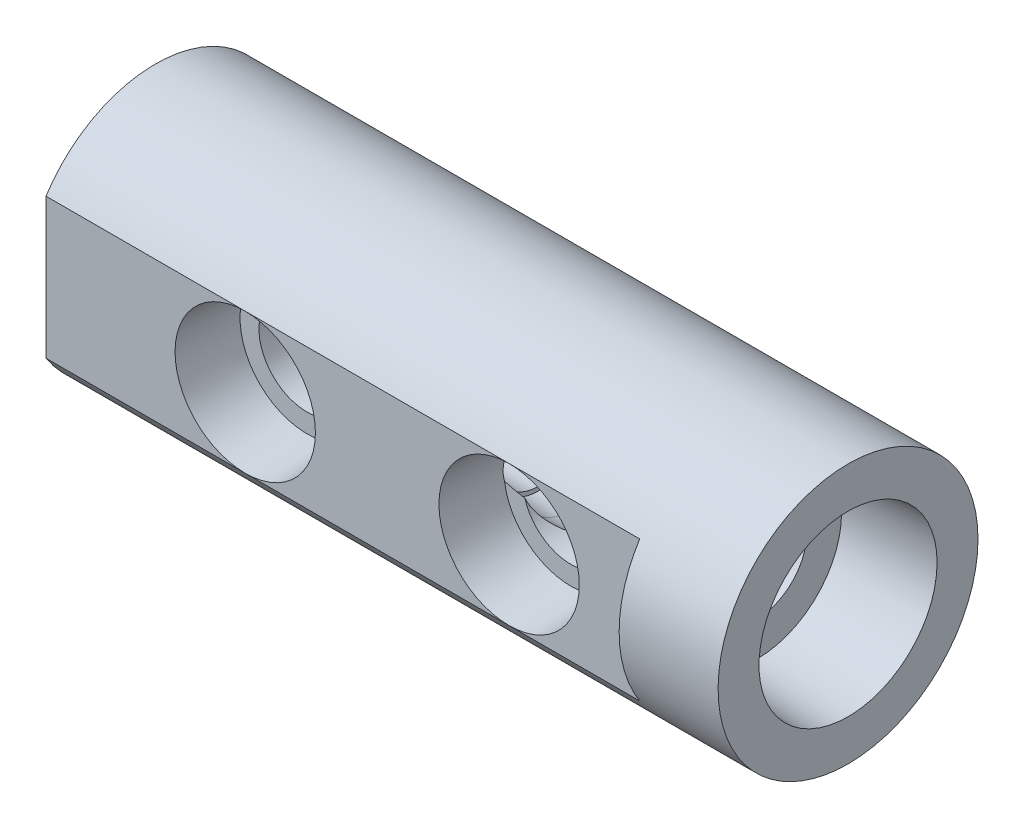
ISO-10303-21;
HEADER;
FILE_DESCRIPTION(('STEP AP214'),'2;1');
FILE_NAME('part.step','',(''),(''),'','','');
FILE_SCHEMA(('AUTOMOTIVE_DESIGN { 1 0 10303 214 1 1 1 1 }'));
ENDSEC;
DATA;
#1=APPLICATION_CONTEXT('core data for automotive mechanical design processes');
#2=APPLICATION_PROTOCOL_DEFINITION('international standard','automotive_design',2000,#1);
#3=PRODUCT_CONTEXT('',#1,'mechanical');
#4=PRODUCT('Part','Part','',(#3));
#5=PRODUCT_RELATED_PRODUCT_CATEGORY('part','',(#4));
#6=PRODUCT_DEFINITION_FORMATION('','',#4);
#7=PRODUCT_DEFINITION_CONTEXT('part definition',#1,'design');
#8=PRODUCT_DEFINITION('design','',#6,#7);
#9=PRODUCT_DEFINITION_SHAPE('','',#8);
#10=(LENGTH_UNIT() NAMED_UNIT(*) SI_UNIT(.MILLI.,.METRE.));
#11=(NAMED_UNIT(*) PLANE_ANGLE_UNIT() SI_UNIT($,.RADIAN.));
#12=(NAMED_UNIT(*) SI_UNIT($,.STERADIAN.) SOLID_ANGLE_UNIT());
#13=UNCERTAINTY_MEASURE_WITH_UNIT(LENGTH_MEASURE(1.E-05),#10,'distance_accuracy_value','');
#14=(GEOMETRIC_REPRESENTATION_CONTEXT(3) GLOBAL_UNCERTAINTY_ASSIGNED_CONTEXT((#13)) GLOBAL_UNIT_ASSIGNED_CONTEXT((#10,
#11,#12)) REPRESENTATION_CONTEXT('',''));
#15=CARTESIAN_POINT('',(0.,0.,0.));
#16=DIRECTION('',(0.,0.,1.));
#17=DIRECTION('',(1.,0.,0.));
#18=AXIS2_PLACEMENT_3D('',#15,#16,#17);
#19=CARTESIAN_POINT('',(46.6400387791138,0.,12.5095));
#20=DIRECTION('',(1.,0.,0.));
#21=DIRECTION('',(0.,0.,1.));
#22=AXIS2_PLACEMENT_3D('',#19,#20,#21);
#23=CYLINDRICAL_SURFACE('',#22,3.6195);
#24=CARTESIAN_POINT('',(23.7998,0.,16.129));
#25=CARTESIAN_POINT('',(23.7998,-0.126298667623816,16.129));
#26=CARTESIAN_POINT('',(23.79463517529,-0.251060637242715,16.1224100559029));
#27=CARTESIAN_POINT('',(23.7745967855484,-0.497684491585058,16.096763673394));
#28=CARTESIAN_POINT('',(23.7597211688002,-0.619545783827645,16.0777047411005));
#29=CARTESIAN_POINT('',(23.7304209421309,-0.800225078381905,16.0399681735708));
#30=CARTESIAN_POINT('',(23.71948818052,-0.860098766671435,16.0258614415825));
#31=CARTESIAN_POINT('',(23.7013645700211,-0.949382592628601,16.0024070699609));
#32=CARTESIAN_POINT('',(23.6950358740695,-0.979056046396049,15.9942063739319));
#33=CARTESIAN_POINT('',(23.6851139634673,-1.02343446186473,15.9813294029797));
#34=CARTESIAN_POINT('',(23.6817335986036,-1.03821151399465,15.9769390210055));
#35=CARTESIAN_POINT('',(23.6748536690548,-1.06762367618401,15.967996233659));
#36=CARTESIAN_POINT('',(23.6713515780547,-1.08227041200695,15.9634405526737));
#37=CARTESIAN_POINT('',(23.6392835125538,-1.21356435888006,15.9216898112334));
#38=CARTESIAN_POINT('',(23.6068834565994,-1.32653725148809,15.879266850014));
#39=CARTESIAN_POINT('',(23.5352602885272,-1.54568294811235,15.7845410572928));
#40=CARTESIAN_POINT('',(23.4960334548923,-1.65185321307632,15.7322354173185));
#41=CARTESIAN_POINT('',(23.4326549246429,-1.80631622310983,15.6466113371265));
#42=CARTESIAN_POINT('',(23.4107712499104,-1.85700345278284,15.6168727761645));
#43=CARTESIAN_POINT('',(23.37687534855,-1.93185846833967,15.5704745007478));
#44=CARTESIAN_POINT('',(23.3653961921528,-1.9566166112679,15.5547067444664));
#45=CARTESIAN_POINT('',(23.3422172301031,-2.00548663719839,15.5227467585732));
#46=CARTESIAN_POINT('',(23.3305023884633,-2.0296323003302,15.5065340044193));
#47=CARTESIAN_POINT('',(23.2713403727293,-2.1489553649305,15.4243256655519));
#48=CARTESIAN_POINT('',(23.2221330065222,-2.23993143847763,15.3549100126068));
#49=CARTESIAN_POINT('',(23.1208929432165,-2.41373203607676,15.2090460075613));
#50=CARTESIAN_POINT('',(23.0688565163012,-2.4965538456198,15.1325971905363));
#51=CARTESIAN_POINT('',(22.9628627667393,-2.65453788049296,14.9725973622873));
#52=CARTESIAN_POINT('',(22.9089013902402,-2.72969931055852,14.8890482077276));
#53=CARTESIAN_POINT('',(22.8408741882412,-2.81900867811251,14.7799109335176));
#54=CARTESIAN_POINT('',(22.827240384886,-2.83663780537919,14.75784747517));
#55=CARTESIAN_POINT('',(22.7999337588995,-2.87143167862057,14.7132378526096));
#56=CARTESIAN_POINT('',(22.7862626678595,-2.88859348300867,14.6906938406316));
#57=CARTESIAN_POINT('',(22.7454085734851,-2.93915259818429,14.6226390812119));
#58=CARTESIAN_POINT('',(22.7183211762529,-2.9717055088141,14.5766036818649));
#59=CARTESIAN_POINT('',(22.6377422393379,-3.06600405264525,14.4364362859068));
#60=CARTESIAN_POINT('',(22.5849227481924,-3.12440125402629,14.3402545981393));
#61=CARTESIAN_POINT('',(22.4825634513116,-3.23250226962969,14.1418218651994));
#62=CARTESIAN_POINT('',(22.4330165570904,-3.28220822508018,14.0395753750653));
#63=CARTESIAN_POINT('',(22.362588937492,-3.35012935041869,13.8808948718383));
#64=CARTESIAN_POINT('',(22.3397659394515,-3.37166011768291,13.8271125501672));
#65=CARTESIAN_POINT('',(22.2957278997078,-3.41243558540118,13.7175886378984));
#66=CARTESIAN_POINT('',(22.2745124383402,-3.43168059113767,13.6618474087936));
#67=CARTESIAN_POINT('',(22.2441625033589,-3.45875379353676,13.5765948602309));
#68=CARTESIAN_POINT('',(22.2342799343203,-3.46748908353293,13.5478645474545));
#69=CARTESIAN_POINT('',(22.2151811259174,-3.48423543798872,13.4902063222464));
#70=CARTESIAN_POINT('',(22.2059511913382,-3.49225892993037,13.4612424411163));
#71=CARTESIAN_POINT('',(22.1792777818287,-3.515275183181,13.3739328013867));
#72=CARTESIAN_POINT('',(22.1628501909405,-3.52921482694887,13.3151693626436));
#73=CARTESIAN_POINT('',(22.1181153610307,-3.5667401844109,13.1370869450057));
#74=CARTESIAN_POINT('',(22.094352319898,-3.5860529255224,13.0159804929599));
#75=CARTESIAN_POINT('',(22.0739307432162,-3.60251296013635,12.8611397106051));
#76=CARTESIAN_POINT('',(22.0703108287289,-3.60541931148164,12.8299983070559));
#77=CARTESIAN_POINT('',(22.0656100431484,-3.60918493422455,12.7830163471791));
#78=CARTESIAN_POINT('',(22.0641631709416,-3.61034229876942,12.7672926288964));
#79=CARTESIAN_POINT('',(22.0615255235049,-3.61245002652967,12.7358478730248));
#80=CARTESIAN_POINT('',(22.0603352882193,-3.61339996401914,12.7201373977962));
#81=CARTESIAN_POINT('',(22.0550265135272,-3.61763358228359,12.6416443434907));
#82=CARTESIAN_POINT('',(22.0528371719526,-3.61937017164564,12.5790397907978));
#83=CARTESIAN_POINT('',(22.0523734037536,-3.61973863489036,12.3917869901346));
#84=CARTESIAN_POINT('',(22.0602252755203,-3.61354257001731,12.2677002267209));
#85=CARTESIAN_POINT('',(22.083537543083,-3.59477660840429,12.0826445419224));
#86=CARTESIAN_POINT('',(22.0932249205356,-3.58693928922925,12.021138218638));
#87=CARTESIAN_POINT('',(22.1076190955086,-3.57515949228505,11.9444730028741));
#88=CARTESIAN_POINT('',(22.1106156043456,-3.57270141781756,11.92913401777));
#89=CARTESIAN_POINT('',(22.1168122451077,-3.56760422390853,11.8985824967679));
#90=CARTESIAN_POINT('',(22.1200124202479,-3.56496508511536,11.8833679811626));
#91=CARTESIAN_POINT('',(22.1299081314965,-3.55678038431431,11.8379033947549));
#92=CARTESIAN_POINT('',(22.1368987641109,-3.55096764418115,11.8078322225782));
#93=CARTESIAN_POINT('',(22.1736864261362,-3.52017376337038,11.6586092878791));
#94=CARTESIAN_POINT('',(22.2089604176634,-3.49002987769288,11.5428390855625));
#95=CARTESIAN_POINT('',(22.2882300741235,-3.41955259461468,11.3172743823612));
#96=CARTESIAN_POINT('',(22.3322300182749,-3.37921357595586,11.207483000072));
#97=CARTESIAN_POINT('',(22.3912133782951,-3.32255620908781,11.0734472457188));
#98=CARTESIAN_POINT('',(22.4032163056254,-3.31090611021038,11.0467885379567));
#99=CARTESIAN_POINT('',(22.4275668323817,-3.28700261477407,10.9938358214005));
#100=CARTESIAN_POINT('',(22.4398782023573,-3.27478486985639,10.9676198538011));
#101=CARTESIAN_POINT('',(22.4771696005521,-3.237344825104,10.8897163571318));
#102=CARTESIAN_POINT('',(22.5025057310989,-3.21133657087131,10.838771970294));
#103=CARTESIAN_POINT('',(22.579579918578,-3.13022269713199,10.6886694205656));
#104=CARTESIAN_POINT('',(22.632371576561,-3.07203883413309,10.5922274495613));
#105=CARTESIAN_POINT('',(22.7392375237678,-2.94745299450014,10.4057230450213));
#106=CARTESIAN_POINT('',(22.7933180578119,-2.88104998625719,10.3156648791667));
#107=CARTESIAN_POINT('',(22.9015612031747,-2.73968048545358,10.1414813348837));
#108=CARTESIAN_POINT('',(22.9557283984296,-2.66471548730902,10.0573575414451));
#109=CARTESIAN_POINT('',(23.0161268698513,-2.57517547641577,9.96598794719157));
#110=CARTESIAN_POINT('',(23.0228341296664,-2.56514832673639,9.955875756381));
#111=CARTESIAN_POINT('',(23.0362024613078,-2.54499164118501,9.9357866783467));
#112=CARTESIAN_POINT('',(23.0428657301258,-2.53485894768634,9.92580642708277));
#113=CARTESIAN_POINT('',(23.0627902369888,-2.5042974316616,9.89605723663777));
#114=CARTESIAN_POINT('',(23.0759861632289,-2.48370519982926,9.87647981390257));
#115=CARTESIAN_POINT('',(23.115292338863,-2.42127082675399,9.81850499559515));
#116=CARTESIAN_POINT('',(23.1411208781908,-2.37877143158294,9.78086435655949));
#117=CARTESIAN_POINT('',(23.2173224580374,-2.24859653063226,9.67092696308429));
#118=CARTESIAN_POINT('',(23.2664122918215,-2.1582518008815,9.60160441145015));
#119=CARTESIAN_POINT('',(23.3603449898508,-1.97001736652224,9.47092481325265));
#120=CARTESIAN_POINT('',(23.40519129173,-1.87212992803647,9.40956691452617));
#121=CARTESIAN_POINT('',(23.4686121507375,-1.71912566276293,9.32378092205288));
#122=CARTESIAN_POINT('',(23.4891101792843,-1.66709311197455,9.29623013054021));
#123=CARTESIAN_POINT('',(23.5187988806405,-1.58740850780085,9.25653287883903));
#124=CARTESIAN_POINT('',(23.5285186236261,-1.56057415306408,9.24357215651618));
#125=CARTESIAN_POINT('',(23.5475878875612,-1.50634243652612,9.21820711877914));
#126=CARTESIAN_POINT('',(23.5569431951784,-1.47892755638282,9.20579514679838));
#127=CARTESIAN_POINT('',(23.6026870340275,-1.34058287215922,9.14524474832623));
#128=CARTESIAN_POINT('',(23.6354379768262,-1.2275104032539,9.10233973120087));
#129=CARTESIAN_POINT('',(23.6927067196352,-0.996415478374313,9.02773621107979));
#130=CARTESIAN_POINT('',(23.7172270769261,-0.878393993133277,8.99603623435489));
#131=CARTESIAN_POINT('',(23.7472980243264,-0.697420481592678,8.95729071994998));
#132=CARTESIAN_POINT('',(23.7562018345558,-0.636437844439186,8.94584618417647));
#133=CARTESIAN_POINT('',(23.7658611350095,-0.55935207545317,8.93344779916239));
#134=CARTESIAN_POINT('',(23.7677194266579,-0.543892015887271,8.9310635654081));
#135=CARTESIAN_POINT('',(23.771286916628,-0.512885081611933,8.92648803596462));
#136=CARTESIAN_POINT('',(23.7729974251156,-0.497325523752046,8.92429506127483));
#137=CARTESIAN_POINT('',(23.777892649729,-0.450607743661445,8.91802113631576));
#138=CARTESIAN_POINT('',(23.780835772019,-0.419466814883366,8.91425193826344));
#139=CARTESIAN_POINT('',(23.7939600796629,-0.263783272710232,8.89745194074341));
#140=CARTESIAN_POINT('',(23.7993752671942,-0.139303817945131,8.89054246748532));
#141=CARTESIAN_POINT('',(23.8001767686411,0.109522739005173,8.8895187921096));
#142=CARTESIAN_POINT('',(23.7955629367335,0.233869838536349,8.89540488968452));
#143=CARTESIAN_POINT('',(23.7834909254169,0.389220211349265,8.91085264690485));
#144=CARTESIAN_POINT('',(23.7807608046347,0.420286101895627,8.91434772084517));
#145=CARTESIAN_POINT('',(23.7746662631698,0.48240945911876,8.92215537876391));
#146=CARTESIAN_POINT('',(23.7712989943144,0.513490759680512,8.92647161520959));
#147=CARTESIAN_POINT('',(23.7602584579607,0.606569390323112,8.9406355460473));
#148=CARTESIAN_POINT('',(23.7517067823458,0.667916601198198,8.95162082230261));
#149=CARTESIAN_POINT('',(23.7226564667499,0.849933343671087,8.98902561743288));
#150=CARTESIAN_POINT('',(23.6987692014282,0.968583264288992,9.01988082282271));
#151=CARTESIAN_POINT('',(23.6427088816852,1.20083072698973,9.09283479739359));
#152=CARTESIAN_POINT('',(23.6105331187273,1.31442715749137,9.13493536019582));
#153=CARTESIAN_POINT('',(23.5699931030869,1.43948073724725,9.18852063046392));
#154=CARTESIAN_POINT('',(23.5654269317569,1.45334104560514,9.19456298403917));
#155=CARTESIAN_POINT('',(23.556200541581,1.48090976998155,9.20678689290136));
#156=CARTESIAN_POINT('',(23.5515373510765,1.49462750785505,9.21297237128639));
#157=CARTESIAN_POINT('',(23.5374009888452,1.53558372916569,9.23174695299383));
#158=CARTESIAN_POINT('',(23.5277810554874,1.56262526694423,9.24455414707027));
#159=CARTESIAN_POINT('',(23.4983586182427,1.64298333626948,9.28383082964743));
#160=CARTESIAN_POINT('',(23.477993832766,1.69553396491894,9.31115461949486));
#161=CARTESIAN_POINT('',(23.4148304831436,1.85026667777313,9.39643609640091));
#162=CARTESIAN_POINT('',(23.369965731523,1.94953755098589,9.45769279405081));
#163=CARTESIAN_POINT('',(23.2991771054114,2.09303138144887,9.55596638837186));
#164=CARTESIAN_POINT('',(23.2749981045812,2.13995846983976,9.58979185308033));
#165=CARTESIAN_POINT('',(23.2379310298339,2.20902732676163,9.64212961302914));
#166=CARTESIAN_POINT('',(23.2254422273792,2.23182987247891,9.65984229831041));
#167=CARTESIAN_POINT('',(23.2002109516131,2.27699861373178,9.69580298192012));
#168=CARTESIAN_POINT('',(23.1874713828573,2.29935845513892,9.71404709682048));
#169=CARTESIAN_POINT('',(23.1234488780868,2.40961074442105,9.80621086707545));
#170=CARTESIAN_POINT('',(23.0709764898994,2.49326689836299,9.88325359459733));
#171=CARTESIAN_POINT('',(22.9644881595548,2.65223795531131,10.0438999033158));
#172=CARTESIAN_POINT('',(22.9104681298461,2.72755074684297,10.1275027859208));
#173=CARTESIAN_POINT('',(22.8019071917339,2.87025525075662,10.3015419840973));
#174=CARTESIAN_POINT('',(22.7473611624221,2.93764700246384,10.3919749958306));
#175=CARTESIAN_POINT('',(22.6796167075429,3.01701700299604,10.5097012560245));
#176=CARTESIAN_POINT('',(22.6660773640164,3.03266146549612,10.5335054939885));
#177=CARTESIAN_POINT('',(22.6391627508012,3.06335200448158,10.5814272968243));
#178=CARTESIAN_POINT('',(22.6257812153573,3.07840587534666,10.6055551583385));
#179=CARTESIAN_POINT('',(22.5858980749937,3.12270280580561,10.6784507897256));
#180=CARTESIAN_POINT('',(22.5596571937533,3.1510819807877,10.7277299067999));
#181=CARTESIAN_POINT('',(22.4822754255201,3.23281057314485,10.8777266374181));
#182=CARTESIAN_POINT('',(22.4324584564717,3.28276518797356,10.9805895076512));
#183=CARTESIAN_POINT('',(22.3382893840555,3.37354508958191,11.1929484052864));
#184=CARTESIAN_POINT('',(22.293928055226,3.41437575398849,11.3024378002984));
#185=CARTESIAN_POINT('',(22.2434918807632,3.45934821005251,11.4443349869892));
#186=CARTESIAN_POINT('',(22.2336574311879,3.46803787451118,11.4729678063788));
#187=CARTESIAN_POINT('',(22.2193217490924,3.48060319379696,11.516319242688));
#188=CARTESIAN_POINT('',(22.2146087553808,3.48471670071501,11.5308489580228));
#189=CARTESIAN_POINT('',(22.2053541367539,3.49276232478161,11.5599634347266));
#190=CARTESIAN_POINT('',(22.2008111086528,3.49669570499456,11.5745519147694));
#191=CARTESIAN_POINT('',(22.1785292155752,3.51591472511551,11.6476529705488));
#192=CARTESIAN_POINT('',(22.1620896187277,3.52985804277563,11.7066412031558));
#193=CARTESIAN_POINT('',(22.1173955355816,3.56733316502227,11.8852295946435));
#194=CARTESIAN_POINT('',(22.0937652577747,3.58652923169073,12.0064502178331));
#195=CARTESIAN_POINT('',(22.0694987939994,3.60608353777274,12.1919949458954));
#196=CARTESIAN_POINT('',(22.0632736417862,3.61105707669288,12.2544630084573));
#197=CARTESIAN_POINT('',(22.0580190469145,3.61524700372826,12.3333774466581));
#198=CARTESIAN_POINT('',(22.0570961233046,3.61598218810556,12.3491809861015));
#199=CARTESIAN_POINT('',(22.0555126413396,3.61724285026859,12.3807229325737));
#200=CARTESIAN_POINT('',(22.0548510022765,3.61776918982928,12.3964770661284));
#201=CARTESIAN_POINT('',(22.0532547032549,3.61903862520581,12.4436892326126));
#202=CARTESIAN_POINT('',(22.0527087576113,3.61947219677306,12.4750970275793));
#203=CARTESIAN_POINT('',(22.0525419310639,3.61960473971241,12.6318051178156));
#204=CARTESIAN_POINT('',(22.06063656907,3.61321573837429,12.7561118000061));
#205=CARTESIAN_POINT('',(22.0842349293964,3.59421297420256,12.9410722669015));
#206=CARTESIAN_POINT('',(22.0940049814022,3.58630527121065,13.0024760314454));
#207=CARTESIAN_POINT('',(22.1113644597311,3.5720919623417,13.0942195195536));
#208=CARTESIAN_POINT('',(22.1176059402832,3.56695829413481,13.1247607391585));
#209=CARTESIAN_POINT('',(22.1309433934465,3.55592086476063,13.1856390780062));
#210=CARTESIAN_POINT('',(22.1380052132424,3.55004532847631,13.2158241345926));
#211=CARTESIAN_POINT('',(22.1751410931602,3.51893900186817,13.3655458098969));
#212=CARTESIAN_POINT('',(22.2106658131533,3.48855162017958,13.4814915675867));
#213=CARTESIAN_POINT('',(22.290292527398,3.41767908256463,13.7070932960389));
#214=CARTESIAN_POINT('',(22.334400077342,3.37718740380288,13.8167451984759));
#215=CARTESIAN_POINT('',(22.393409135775,3.320430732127,13.9504594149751));
#216=CARTESIAN_POINT('',(22.4054060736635,3.30877100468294,13.9770338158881));
#217=CARTESIAN_POINT('',(22.4236701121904,3.29081842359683,14.0166511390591));
#218=CARTESIAN_POINT('',(22.4298029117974,3.28475705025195,14.0298161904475));
#219=CARTESIAN_POINT('',(22.4421542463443,3.27247970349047,14.0560661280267));
#220=CARTESIAN_POINT('',(22.4483767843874,3.26625969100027,14.0691593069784));
#221=CARTESIAN_POINT('',(22.4796357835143,3.23483140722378,14.1343059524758));
#222=CARTESIAN_POINT('',(22.5051045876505,3.20864552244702,14.1853966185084));
#223=CARTESIAN_POINT('',(22.5825317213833,3.12702080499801,14.335846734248));
#224=CARTESIAN_POINT('',(22.6354982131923,3.06852573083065,14.4323994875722));
#225=CARTESIAN_POINT('',(22.7425837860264,2.94341167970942,14.6189360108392));
#226=CARTESIAN_POINT('',(22.7967093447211,2.8767914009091,14.7089150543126));
#227=CARTESIAN_POINT('',(22.9049134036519,2.73512086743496,14.8827823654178));
#228=CARTESIAN_POINT('',(22.9589965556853,2.6600718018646,14.9666687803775));
#229=CARTESIAN_POINT('',(23.0259238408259,2.56059370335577,15.0678090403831));
#230=CARTESIAN_POINT('',(23.0392756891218,2.54041385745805,15.0878504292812));
#231=CARTESIAN_POINT('',(23.0658964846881,2.49947198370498,15.1275590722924));
#232=CARTESIAN_POINT('',(23.0791709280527,2.47870013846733,15.1472340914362));
#233=CARTESIAN_POINT('',(23.1186439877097,2.41581714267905,15.2053985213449));
#234=CARTESIAN_POINT('',(23.1445589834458,2.37303795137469,15.2431282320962));
#235=CARTESIAN_POINT('',(23.2209481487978,2.24209220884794,15.3532319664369));
#236=CARTESIAN_POINT('',(23.2700670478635,2.15132445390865,15.4225310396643));
#237=CARTESIAN_POINT('',(23.3638865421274,1.96249225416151,15.5529472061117));
#238=CARTESIAN_POINT('',(23.4085904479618,1.86442963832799,15.6140647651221));
#239=CARTESIAN_POINT('',(23.4927265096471,1.66040967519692,15.7278007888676));
#240=CARTESIAN_POINT('',(23.5321627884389,1.55445613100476,15.7804222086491));
#241=CARTESIAN_POINT('',(23.5775274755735,1.41650320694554,15.8404464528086));
#242=CARTESIAN_POINT('',(23.5864032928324,1.38863609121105,15.8521625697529));
#243=CARTESIAN_POINT('',(23.5994073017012,1.34640648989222,15.869291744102));
#244=CARTESIAN_POINT('',(23.6036903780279,1.33225775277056,15.8749273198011));
#245=CARTESIAN_POINT('',(23.6121213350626,1.3039160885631,15.8860092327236));
#246=CARTESIAN_POINT('',(23.6162730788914,1.28971076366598,15.8914606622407));
#247=CARTESIAN_POINT('',(23.6367109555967,1.21851128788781,15.9182702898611));
#248=CARTESIAN_POINT('',(23.6520349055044,1.1609988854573,15.9382868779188));
#249=CARTESIAN_POINT('',(23.6948365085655,0.986781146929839,15.9940248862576));
#250=CARTESIAN_POINT('',(23.7191501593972,0.868399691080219,16.0254474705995));
#251=CARTESIAN_POINT('',(23.7488295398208,0.687310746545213,16.0636792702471));
#252=CARTESIAN_POINT('',(23.7575893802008,0.62636058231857,16.0749363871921));
#253=CARTESIAN_POINT('',(23.7689560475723,0.534023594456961,16.0895237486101));
#254=CARTESIAN_POINT('',(23.7724492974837,0.503092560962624,16.0940029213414));
#255=CARTESIAN_POINT('',(23.7788306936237,0.440920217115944,16.1021804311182));
#256=CARTESIAN_POINT('',(23.7817201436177,0.409662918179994,16.1058804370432));
#257=CARTESIAN_POINT('',(23.7894499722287,0.315516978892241,16.1157739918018));
#258=CARTESIAN_POINT('',(23.7933241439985,0.252611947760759,16.1207260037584));
#259=CARTESIAN_POINT('',(23.7972053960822,0.158042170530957,16.1256857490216));
#260=CARTESIAN_POINT('',(23.7981773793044,0.126483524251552,16.1269274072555));
#261=CARTESIAN_POINT('',(23.7991503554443,0.079092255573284,16.1281702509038));
#262=CARTESIAN_POINT('',(23.7995155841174,0.0553832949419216,16.1286367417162));
#263=CARTESIAN_POINT('',(23.7997288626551,0.0276994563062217,16.1289091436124));
#264=CARTESIAN_POINT('',(23.7997745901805,0.0158299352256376,16.1289675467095));
#265=CARTESIAN_POINT('',(23.7997949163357,0.0079158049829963,16.1289935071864));
#266=CARTESIAN_POINT('',(23.7998,0.00394683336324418,16.129));
#267=CARTESIAN_POINT('',(23.7998,0.,16.129));
#268=B_SPLINE_CURVE_WITH_KNOTS('',3,(#24,#25,#26,#27,#28,#29,#30,#31,#32,#33,#34,#35,#36,#37,
#38,#39,#40,#41,#42,#43,#44,#45,#46,#47,#48,#49,#50,#51,#52,#53,#54,#55,#56,#57,#58,#59,#60,#61,
#62,#63,#64,#65,#66,#67,#68,#69,#70,#71,#72,#73,#74,#75,#76,#77,#78,#79,#80,#81,#82,#83,#84,#85,
#86,#87,#88,#89,#90,#91,#92,#93,#94,#95,#96,#97,#98,#99,#100,#101,#102,#103,#104,#105,#106,#107,
#108,#109,#110,#111,#112,#113,#114,#115,#116,#117,#118,#119,#120,#121,#122,#123,#124,#125,#126,
#127,#128,#129,#130,#131,#132,#133,#134,#135,#136,#137,#138,#139,#140,#141,#142,#143,#144,#145,
#146,#147,#148,#149,#150,#151,#152,#153,#154,#155,#156,#157,#158,#159,#160,#161,#162,#163,#164,
#165,#166,#167,#168,#169,#170,#171,#172,#173,#174,#175,#176,#177,#178,#179,#180,#181,#182,#183,
#184,#185,#186,#187,#188,#189,#190,#191,#192,#193,#194,#195,#196,#197,#198,#199,#200,#201,#202,
#203,#204,#205,#206,#207,#208,#209,#210,#211,#212,#213,#214,#215,#216,#217,#218,#219,#220,#221,
#222,#223,#224,#225,#226,#227,#228,#229,#230,#231,#232,#233,#234,#235,#236,#237,#238,#239,#240,
#241,#242,#243,#244,#245,#246,#247,#248,#249,#250,#251,#252,#253,#254,#255,#256,#257,#258,#259,
#260,#261,#262,#263,#264,#265,#266,#267),.UNSPECIFIED.,.T.,.F.,(4,2,2,2,2,2,2,2,2,2,2,2,2,2,2,2,
2,2,2,2,2,2,2,2,2,2,2,2,2,2,2,2,2,2,2,2,2,2,2,2,2,2,2,2,2,2,2,2,2,2,2,2,2,2,2,2,2,2,2,2,2,2,2,2,
2,2,2,2,2,2,2,2,2,2,2,2,2,2,2,2,2,2,2,2,2,2,2,2,2,2,2,2,2,2,2,2,2,2,2,2,2,2,2,2,2,2,2,2,2,2,2,2,
2,2,2,2,2,2,2,1,1,2,4),(0.,0.0156249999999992,0.0312499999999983,0.0390624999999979,
0.0429687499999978,0.0449218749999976,0.0468749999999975,0.0624999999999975,0.0781249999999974,
0.0859374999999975,0.0898437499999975,0.0937499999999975,0.109374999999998,0.124999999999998,
0.140625,0.144531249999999,0.1484375,0.15625,0.171875,0.1875,0.1953125,0.203125,
0.207031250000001,0.2109375,0.21875,0.234375,0.238281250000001,0.240234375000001,0.2421875,0.25,
0.265625,0.273437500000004,0.275390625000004,0.277343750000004,0.281250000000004,
0.296875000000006,0.312500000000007,0.316406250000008,0.320312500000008,0.328125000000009,
0.34375000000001,0.359375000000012,0.375000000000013,0.376953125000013,0.378906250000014,
0.382812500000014,0.390625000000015,0.406250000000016,0.421875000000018,0.429687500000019,
0.433593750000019,0.43750000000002,0.453125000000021,0.468750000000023,0.476562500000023,
0.478515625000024,0.480468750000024,0.484375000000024,0.500000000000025,0.515625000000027,
0.519531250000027,0.523437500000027,0.531250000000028,0.54687500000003,0.562500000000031,
0.564453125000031,0.566406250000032,0.570312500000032,0.578125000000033,0.593750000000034,
0.601562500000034,0.605468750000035,0.609375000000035,0.625000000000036,0.640625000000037,
0.656250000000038,0.660156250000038,0.664062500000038,0.671875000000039,0.687500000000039,
0.703125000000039,0.707031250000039,0.708984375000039,0.710937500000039,0.718750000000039,
0.734375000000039,0.742187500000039,0.744140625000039,0.746093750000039,0.750000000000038,
0.765625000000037,0.773437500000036,0.777343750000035,0.781250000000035,0.796875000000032,
0.81250000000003,0.816406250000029,0.818359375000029,0.820312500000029,0.828125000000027,
0.843750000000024,0.859375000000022,0.875000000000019,0.878906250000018,0.882812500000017,
0.890625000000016,0.906250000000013,0.92187500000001,0.9375,0.941406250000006,0.943359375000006,
0.9453125,0.953125,0.96875,0.9765625,0.980468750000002,0.984375,0.9921875,0.99609375,
0.998046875,0.9990234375,0.99951171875,1.),.UNSPECIFIED.);
#269=CARTESIAN_POINT('',(23.7998,0.,16.129));
#270=VERTEX_POINT('',#269);
#271=EDGE_CURVE('E161',#270,#270,#268,.T.);
#272=ORIENTED_EDGE('',*,*,#271,.F.);
#273=EDGE_LOOP('',(#272));
#274=FACE_BOUND('',#273,.T.);
#275=CARTESIAN_POINT('',(27.051,0.,12.5095));
#276=DIRECTION('',(1.,0.,0.));
#277=DIRECTION('',(0.,0.,-1.));
#278=AXIS2_PLACEMENT_3D('',#275,#276,#277);
#279=CIRCLE('',#278,3.6195);
#280=CARTESIAN_POINT('',(27.051,0.,8.89));
#281=VERTEX_POINT('',#280);
#282=EDGE_CURVE('E358',#281,#281,#279,.T.);
#283=ORIENTED_EDGE('',*,*,#282,.T.);
#284=EDGE_LOOP('',(#283));
#285=FACE_BOUND('',#284,.T.);
#286=ADVANCED_FACE('F16',(#274,#285),#23,.F.);
#287=CARTESIAN_POINT('',(36.9210370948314,0.,16.129));
#288=DIRECTION('',(-1.,0.,0.));
#289=DIRECTION('',(0.,0.,1.));
#290=AXIS2_PLACEMENT_3D('',#287,#288,#289);
#291=PLANE('',#290);
#292=CARTESIAN_POINT('',(36.9210370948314,0.,12.5095));
#293=DIRECTION('',(-1.,0.,0.));
#294=DIRECTION('',(0.,0.,1.));
#295=AXIS2_PLACEMENT_3D('',#292,#293,#294);
#296=CIRCLE('',#295,4.60353866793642);
#297=CARTESIAN_POINT('',(36.9210370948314,0.,17.1130386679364));
#298=VERTEX_POINT('',#297);
#299=EDGE_CURVE('E11',#298,#298,#296,.F.);
#300=ORIENTED_EDGE('',*,*,#299,.T.);
#301=EDGE_LOOP('',(#300));
#302=FACE_BOUND('',#301,.T.);
#303=CARTESIAN_POINT('',(36.9210370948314,0.,12.5095));
#304=DIRECTION('',(1.,0.,0.));
#305=DIRECTION('',(0.,0.,-1.));
#306=AXIS2_PLACEMENT_3D('',#303,#304,#305);
#307=CIRCLE('',#306,4.2164);
#308=CARTESIAN_POINT('',(36.9210370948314,0.,8.2931));
#309=VERTEX_POINT('',#308);
#310=EDGE_CURVE('E355',#309,#309,#307,.T.);
#311=ORIENTED_EDGE('',*,*,#310,.F.);
#312=EDGE_LOOP('',(#311));
#313=FACE_BOUND('',#312,.T.);
#314=ADVANCED_FACE('F379',(#302,#313),#291,.F.);
#315=CARTESIAN_POINT('',(39.9542,0.,12.5095));
#316=DIRECTION('',(1.,0.,0.));
#317=DIRECTION('',(0.,0.,-1.));
#318=AXIS2_PLACEMENT_3D('',#315,#316,#317);
#319=CONICAL_SURFACE('',#318,4.7625,0.0523598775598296);
#320=CARTESIAN_POINT('',(39.9542,0.,12.5095));
#321=DIRECTION('',(-1.,0.,0.));
#322=DIRECTION('',(0.,0.,1.));
#323=AXIS2_PLACEMENT_3D('',#320,#321,#322);
#324=CIRCLE('',#323,4.7625);
#325=CARTESIAN_POINT('',(39.9542,0.,7.747));
#326=VERTEX_POINT('',#325);
#327=CARTESIAN_POINT('',(39.9542,-1.28915947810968,17.0942));
#328=VERTEX_POINT('',#327);
#329=EDGE_CURVE('E208',#326,#328,#324,.T.);
#330=ORIENTED_EDGE('',*,*,#329,.F.);
#331=CARTESIAN_POINT('',(39.9542,0.,12.5095));
#332=DIRECTION('',(-1.,0.,0.));
#333=DIRECTION('',(0.,0.,1.));
#334=AXIS2_PLACEMENT_3D('',#331,#332,#333);
#335=CIRCLE('',#334,4.7625);
#336=CARTESIAN_POINT('',(39.9542,1.28915947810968,17.0942));
#337=VERTEX_POINT('',#336);
#338=EDGE_CURVE('E220',#337,#326,#335,.T.);
#339=ORIENTED_EDGE('',*,*,#338,.F.);
#340=CARTESIAN_POINT('',(38.196147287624,0.890409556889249,17.0942));
#341=CARTESIAN_POINT('',(38.2686835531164,0.910348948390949,17.0942));
#342=CARTESIAN_POINT('',(38.3414556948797,0.929709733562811,17.0942));
#343=CARTESIAN_POINT('',(38.4871831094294,0.967404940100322,17.0942));
#344=CARTESIAN_POINT('',(38.5601374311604,0.985739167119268,17.0942));
#345=CARTESIAN_POINT('',(38.7792314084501,1.03943304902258,17.0942));
#346=CARTESIAN_POINT('',(38.9256001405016,1.07349487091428,17.0942));
#347=CARTESIAN_POINT('',(39.2187990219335,1.13900435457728,17.0942));
#348=CARTESIAN_POINT('',(39.3656302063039,1.17044615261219,17.0942));
#349=CARTESIAN_POINT('',(39.6596576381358,1.23126148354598,17.0942));
#350=CARTESIAN_POINT('',(39.8068543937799,1.26063213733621,17.0942));
#351=CARTESIAN_POINT('',(39.9542,1.28915947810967,17.0942));
#352=B_SPLINE_CURVE_WITH_KNOTS('',3,(#340,#341,#342,#343,#344,#345,#346,#347,#348,#349,#350,
#351),.UNSPECIFIED.,.F.,.F.,(4,2,2,2,2,4),(0.,0.125,0.25,0.5,0.75,1.),.UNSPECIFIED.);
#353=CARTESIAN_POINT('',(38.1961472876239,0.890409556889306,17.0942));
#354=VERTEX_POINT('',#353);
#355=EDGE_CURVE('E229',#354,#337,#352,.T.);
#356=ORIENTED_EDGE('',*,*,#355,.F.);
#357=CARTESIAN_POINT('',(38.196147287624,-0.890409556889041,17.0942));
#358=CARTESIAN_POINT('',(38.1742271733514,-0.743687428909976,17.1215251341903));
#359=CARTESIAN_POINT('',(38.1577553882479,-0.596383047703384,17.1419827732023));
#360=CARTESIAN_POINT('',(38.1356876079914,-0.3006214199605,17.1693711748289));
#361=CARTESIAN_POINT('',(38.1300913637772,-0.152164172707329,17.1763017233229));
#362=CARTESIAN_POINT('',(38.1299755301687,0.0713969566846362,17.1764452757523));
#363=CARTESIAN_POINT('',(38.1313181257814,0.146063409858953,17.1747817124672));
#364=CARTESIAN_POINT('',(38.1354328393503,0.258285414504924,17.1696805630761));
#365=CARTESIAN_POINT('',(38.1371546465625,0.295729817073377,17.1675456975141));
#366=CARTESIAN_POINT('',(38.1413048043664,0.370693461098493,17.162398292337));
#367=CARTESIAN_POINT('',(38.1437364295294,0.408249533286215,17.1593816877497));
#368=CARTESIAN_POINT('',(38.1576132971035,0.595416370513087,17.1421593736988));
#369=CARTESIAN_POINT('',(38.174220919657,0.743645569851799,17.1215329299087));
#370=CARTESIAN_POINT('',(38.196147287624,0.890409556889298,17.0942));
#371=B_SPLINE_CURVE_WITH_KNOTS('',3,(#357,#358,#359,#360,#361,#362,#363,#364,#365,#366,#367,
#368,#369,#370),.UNSPECIFIED.,.F.,.F.,(4,2,2,2,2,2,4),(0.,0.25,0.5,0.625,0.6875,0.75,1.),.UNSPECIFIED.);
#372=CARTESIAN_POINT('',(38.196147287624,-0.890409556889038,17.0942));
#373=VERTEX_POINT('',#372);
#374=EDGE_CURVE('E180',#373,#354,#371,.T.);
#375=ORIENTED_EDGE('',*,*,#374,.F.);
#376=CARTESIAN_POINT('',(39.9542,-1.28915947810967,17.0942));
#377=CARTESIAN_POINT('',(39.8067388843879,-1.26060977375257,17.0942));
#378=CARTESIAN_POINT('',(39.65940295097,-1.23121087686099,17.0942));
#379=CARTESIAN_POINT('',(39.3650393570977,-1.17032186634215,17.0942));
#380=CARTESIAN_POINT('',(39.2180112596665,-1.13883471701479,17.0942));
#381=CARTESIAN_POINT('',(38.9243460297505,-1.07320824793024,17.0942));
#382=CARTESIAN_POINT('',(38.7779054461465,-1.03911769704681,17.0942));
#383=CARTESIAN_POINT('',(38.4861182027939,-0.967589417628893,17.0942));
#384=CARTESIAN_POINT('',(38.3407592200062,-0.930161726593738,17.0942));
#385=CARTESIAN_POINT('',(38.1961472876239,-0.890409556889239,17.0942));
#386=B_SPLINE_CURVE_WITH_KNOTS('',3,(#376,#377,#378,#379,#380,#381,#382,#383,#384,#385),
.UNSPECIFIED.,.F.,.F.,(4,2,2,2,4),(0.,0.25,0.5,0.75,1.),.UNSPECIFIED.);
#387=EDGE_CURVE('E234',#328,#373,#386,.T.);
#388=ORIENTED_EDGE('',*,*,#387,.F.);
#389=EDGE_LOOP('',(#330,#339,#356,#375,#388));
#390=FACE_BOUND('',#389,.T.);
#391=ORIENTED_EDGE('',*,*,#299,.F.);
#392=EDGE_LOOP('',(#391));
#393=FACE_BOUND('',#392,.T.);
#394=ADVANCED_FACE('F386',(#390,#393),#319,.F.);
#395=CARTESIAN_POINT('',(44.577,0.,5.46297482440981));
#396=DIRECTION('',(0.,0.,1.));
#397=DIRECTION('',(1.,0.,0.));
#398=AXIS2_PLACEMENT_3D('',#395,#396,#397);
#399=CONICAL_SURFACE('',#398,4.6228,1.0471975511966);
#400=CARTESIAN_POINT('',(44.577,0.,2.794));
#401=VERTEX_POINT('',#400);
#402=VERTEX_LOOP('',#401);
#403=FACE_BOUND('',#402,.T.);
#404=CARTESIAN_POINT('',(44.577,0.,5.46297482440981));
#405=DIRECTION('',(0.,0.,-1.));
#406=DIRECTION('',(-1.,0.,0.));
#407=AXIS2_PLACEMENT_3D('',#404,#405,#406);
#408=CIRCLE('',#407,4.6228);
#409=CARTESIAN_POINT('',(49.1998,0.,5.46297482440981));
#410=VERTEX_POINT('',#409);
#411=EDGE_CURVE('E315',#410,#410,#408,.T.);
#412=ORIENTED_EDGE('',*,*,#411,.F.);
#413=EDGE_LOOP('',(#412));
#414=FACE_BOUND('',#413,.T.);
#415=ADVANCED_FACE('F513',(#403,#414),#399,.F.);
#416=CARTESIAN_POINT('',(6.35,-7.33234841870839,12.5095));
#417=DIRECTION('',(-1.,0.,0.));
#418=DIRECTION('',(0.,-1.,0.));
#419=AXIS2_PLACEMENT_3D('',#416,#417,#418);
#420=PLANE('',#419);
#421=DIRECTION('',(0.,0.5,-0.866025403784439));
#422=VECTOR('',#421,1.);
#423=CARTESIAN_POINT('',(6.35,-7.33234841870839,12.5095));
#424=LINE('',#423,#422);
#425=CARTESIAN_POINT('',(6.35,-7.33234841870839,12.5095));
#426=VERTEX_POINT('',#425);
#427=CARTESIAN_POINT('',(6.35,-3.66617420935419,6.15949999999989));
#428=VERTEX_POINT('',#427);
#429=EDGE_CURVE('E284',#426,#428,#424,.T.);
#430=ORIENTED_EDGE('',*,*,#429,.F.);
#431=DIRECTION('',(0.,-0.500000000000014,-0.866025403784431));
#432=VECTOR('',#431,1.);
#433=CARTESIAN_POINT('',(6.35,-3.6661742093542,18.8595));
#434=LINE('',#433,#432);
#435=CARTESIAN_POINT('',(6.35,-3.6661742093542,18.8595));
#436=VERTEX_POINT('',#435);
#437=EDGE_CURVE('E277',#436,#426,#434,.T.);
#438=ORIENTED_EDGE('',*,*,#437,.F.);
#439=DIRECTION('',(0.,-1.,0.));
#440=VECTOR('',#439,1.);
#441=CARTESIAN_POINT('',(6.35,3.66617420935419,18.8595));
#442=LINE('',#441,#440);
#443=CARTESIAN_POINT('',(6.35,3.66617420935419,18.8595));
#444=VERTEX_POINT('',#443);
#445=EDGE_CURVE('E304',#444,#436,#442,.T.);
#446=ORIENTED_EDGE('',*,*,#445,.F.);
#447=DIRECTION('',(0.,-0.500000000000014,0.866025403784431));
#448=VECTOR('',#447,1.);
#449=CARTESIAN_POINT('',(6.35,7.33234841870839,12.5095));
#450=LINE('',#449,#448);
#451=CARTESIAN_POINT('',(6.35,7.33234841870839,12.5095));
#452=VERTEX_POINT('',#451);
#453=EDGE_CURVE('E305',#452,#444,#450,.T.);
#454=ORIENTED_EDGE('',*,*,#453,.F.);
#455=DIRECTION('',(0.,0.5,0.866025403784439));
#456=VECTOR('',#455,1.);
#457=CARTESIAN_POINT('',(6.35,3.6661742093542,6.15949999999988));
#458=LINE('',#457,#456);
#459=CARTESIAN_POINT('',(6.35,3.6661742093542,6.15949999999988));
#460=VERTEX_POINT('',#459);
#461=EDGE_CURVE('E298',#460,#452,#458,.T.);
#462=ORIENTED_EDGE('',*,*,#461,.F.);
#463=DIRECTION('',(0.,1.,0.));
#464=VECTOR('',#463,1.);
#465=CARTESIAN_POINT('',(6.35,-3.66617420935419,6.15949999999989));
#466=LINE('',#465,#464);
#467=EDGE_CURVE('E291',#428,#460,#466,.T.);
#468=ORIENTED_EDGE('',*,*,#467,.F.);
#469=EDGE_LOOP('',(#430,#438,#446,#454,#462,#468));
#470=FACE_BOUND('',#469,.T.);
#471=ADVANCED_FACE('F651',(#470),#420,.T.);
#472=CARTESIAN_POINT('',(66.675,0.,12.5095));
#473=DIRECTION('',(1.,0.,0.));
#474=DIRECTION('',(0.,0.,-1.));
#475=AXIS2_PLACEMENT_3D('',#472,#473,#474);
#476=CONICAL_SURFACE('',#475,8.5725,0.0523598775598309);
#477=CARTESIAN_POINT('',(57.9374,0.,12.5095));
#478=DIRECTION('',(-1.,0.,0.));
#479=DIRECTION('',(0.,0.,1.));
#480=AXIS2_PLACEMENT_3D('',#477,#478,#479);
#481=CIRCLE('',#480,8.1145817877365);
#482=CARTESIAN_POINT('',(57.9374,0.,4.3949182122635));
#483=VERTEX_POINT('',#482);
#484=EDGE_CURVE('E25',#483,#483,#481,.T.);
#485=ORIENTED_EDGE('',*,*,#484,.T.);
#486=EDGE_LOOP('',(#485));
#487=FACE_BOUND('',#486,.T.);
#488=CARTESIAN_POINT('',(66.675,0.,12.5095));
#489=DIRECTION('',(-1.,0.,0.));
#490=DIRECTION('',(0.,0.,1.));
#491=AXIS2_PLACEMENT_3D('',#488,#489,#490);
#492=CIRCLE('',#491,8.5725);
#493=CARTESIAN_POINT('',(66.675,0.,3.937));
#494=VERTEX_POINT('',#493);
#495=EDGE_CURVE('E268',#494,#494,#492,.T.);
#496=ORIENTED_EDGE('',*,*,#495,.F.);
#497=EDGE_LOOP('',(#496));
#498=FACE_BOUND('',#497,.T.);
#499=ADVANCED_FACE('F658',(#487,#498),#476,.F.);
#500=CARTESIAN_POINT('',(57.9374,0.,4.39491821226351));
#501=DIRECTION('',(1.,0.,0.));
#502=DIRECTION('',(0.,0.,-1.));
#503=AXIS2_PLACEMENT_3D('',#500,#501,#502);
#504=PLANE('',#503);
#505=ORIENTED_EDGE('',*,*,#484,.F.);
#506=EDGE_LOOP('',(#505));
#507=FACE_BOUND('',#506,.T.);
#508=CARTESIAN_POINT('',(57.9374,0.,12.5095));
#509=DIRECTION('',(1.,0.,0.));
#510=DIRECTION('',(0.,0.,-1.));
#511=AXIS2_PLACEMENT_3D('',#508,#509,#510);
#512=CIRCLE('',#511,4.7625);
#513=CARTESIAN_POINT('',(57.9374,0.,17.272));
#514=VERTEX_POINT('',#513);
#515=EDGE_CURVE('E333',#514,#514,#512,.F.);
#516=ORIENTED_EDGE('',*,*,#515,.T.);
#517=EDGE_LOOP('',(#516));
#518=FACE_BOUND('',#517,.T.);
#519=ADVANCED_FACE('F667',(#507,#518),#504,.T.);
#520=CARTESIAN_POINT('',(44.577,0.,17.0942));
#521=DIRECTION('',(0.,0.,-1.));
#522=DIRECTION('',(-1.,0.,0.));
#523=AXIS2_PLACEMENT_3D('',#520,#521,#522);
#524=CYLINDRICAL_SURFACE('',#523,4.6228);
#525=CARTESIAN_POINT('',(44.577,0.,17.0942));
#526=DIRECTION('',(0.,0.,-1.));
#527=DIRECTION('',(-1.,0.,0.));
#528=AXIS2_PLACEMENT_3D('',#525,#526,#527);
#529=CIRCLE('',#528,4.6228);
#530=CARTESIAN_POINT('',(40.1375915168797,1.28915947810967,17.0942));
#531=VERTEX_POINT('',#530);
#532=CARTESIAN_POINT('',(49.0164084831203,1.28915947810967,17.0942));
#533=VERTEX_POINT('',#532);
#534=EDGE_CURVE('E225',#531,#533,#529,.T.);
#535=ORIENTED_EDGE('',*,*,#534,.F.);
#536=CARTESIAN_POINT('',(40.1375915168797,1.28915947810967,17.0942));
#537=CARTESIAN_POINT('',(40.1771137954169,1.42526020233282,17.0559302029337));
#538=CARTESIAN_POINT('',(40.2219947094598,1.55653489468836,17.012502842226));
#539=CARTESIAN_POINT('',(40.3213083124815,1.81051379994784,16.9165256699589));
#540=CARTESIAN_POINT('',(40.3757460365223,1.93321336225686,16.8639707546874));
#541=CARTESIAN_POINT('',(40.4934177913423,2.17076141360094,16.7505522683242));
#542=CARTESIAN_POINT('',(40.5566545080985,2.2856073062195,16.6896857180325));
#543=CARTESIAN_POINT('',(40.657751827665,2.4523454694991,16.5925802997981));
#544=CARTESIAN_POINT('',(40.6924932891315,2.50700140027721,16.5592425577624));
#545=CARTESIAN_POINT('',(40.7371993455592,2.57419333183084,16.5163926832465));
#546=CARTESIAN_POINT('',(40.746207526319,2.58757947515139,16.5077609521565));
#547=CARTESIAN_POINT('',(40.7643052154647,2.61417233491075,16.4904246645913));
#548=CARTESIAN_POINT('',(40.7734000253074,2.62738712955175,16.4817150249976));
#549=CARTESIAN_POINT('',(40.8008203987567,2.66679052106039,16.455463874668));
#550=CARTESIAN_POINT('',(40.8192818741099,2.69273818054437,16.4378001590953));
#551=CARTESIAN_POINT('',(40.9124713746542,2.82091884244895,16.3486952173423));
#552=CARTESIAN_POINT('',(40.9898371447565,2.91849314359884,16.2749014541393));
#553=CARTESIAN_POINT('',(41.1497305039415,3.10470020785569,16.1229037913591));
#554=CARTESIAN_POINT('',(41.2322595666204,3.19332946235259,16.0446975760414));
#555=CARTESIAN_POINT('',(41.4022076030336,3.36234068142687,15.884354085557));
#556=CARTESIAN_POINT('',(41.4896269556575,3.44272058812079,15.8022149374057));
#557=CARTESIAN_POINT('',(41.6243411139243,3.55746605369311,15.6763697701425));
#558=CARTESIAN_POINT('',(41.6698445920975,3.59474232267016,15.6339816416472));
#559=CARTESIAN_POINT('',(41.7389991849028,3.649231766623,15.569778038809));
#560=CARTESIAN_POINT('',(41.7622006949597,3.66715734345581,15.5482732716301));
#561=CARTESIAN_POINT('',(41.8089049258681,3.7025380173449,15.5050630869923));
#562=CARTESIAN_POINT('',(41.832424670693,3.72000543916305,15.4833419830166));
#563=CARTESIAN_POINT('',(41.9505748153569,3.80602685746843,15.3744418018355));
#564=CARTESIAN_POINT('',(42.0465383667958,3.87042392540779,15.2866640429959));
#565=CARTESIAN_POINT('',(42.2414591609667,3.99107334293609,15.1102989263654));
#566=CARTESIAN_POINT('',(42.3404136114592,4.0473239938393,15.021707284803));
#567=CARTESIAN_POINT('',(42.5416361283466,4.15216137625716,14.844360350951));
#568=CARTESIAN_POINT('',(42.6438975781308,4.20074753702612,14.7555967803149));
#569=CARTESIAN_POINT('',(42.8002746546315,4.26810826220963,14.6230548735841));
#570=CARTESIAN_POINT('',(42.8529010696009,4.28964077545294,14.5789780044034));
#571=CARTESIAN_POINT('',(42.9592962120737,4.33088553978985,14.4912133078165));
#572=CARTESIAN_POINT('',(43.0130641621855,4.35059786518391,14.4475245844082));
#573=CARTESIAN_POINT('',(43.1219411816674,4.3882115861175,14.3607806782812));
#574=CARTESIAN_POINT('',(43.1770489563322,4.40611313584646,14.3177240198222));
#575=CARTESIAN_POINT('',(43.2888933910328,4.44009878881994,14.2325872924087));
#576=CARTESIAN_POINT('',(43.345627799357,4.45618320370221,14.1905046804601));
#577=CARTESIAN_POINT('',(43.461153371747,4.48650560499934,14.1078156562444));
#578=CARTESIAN_POINT('',(43.5199404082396,4.5007442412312,14.0672046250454));
#579=CARTESIAN_POINT('',(43.5951217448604,4.51734789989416,14.017837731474));
#580=CARTESIAN_POINT('',(43.6102499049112,4.5206100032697,14.0080312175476));
#581=CARTESIAN_POINT('',(43.6406149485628,4.52699719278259,13.9886237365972));
#582=CARTESIAN_POINT('',(43.6558597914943,4.53012410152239,13.9790174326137));
#583=CARTESIAN_POINT('',(43.7017957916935,4.53930310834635,13.9505176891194));
#584=CARTESIAN_POINT('',(43.7326878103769,4.5451536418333,13.9319423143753));
#585=CARTESIAN_POINT('',(43.8263038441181,4.56188059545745,13.8777403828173));
#586=CARTESIAN_POINT('',(43.8899537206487,4.57193635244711,13.8436125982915));
#587=CARTESIAN_POINT('',(43.988040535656,4.58524757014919,13.7968127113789));
#588=CARTESIAN_POINT('',(44.021174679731,4.58938837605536,13.7819504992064));
#589=CARTESIAN_POINT('',(44.0716641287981,4.59512811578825,13.761001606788));
#590=CARTESIAN_POINT('',(44.0886449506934,4.59696464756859,13.754235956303));
#591=CARTESIAN_POINT('',(44.1228046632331,4.6004653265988,13.7412346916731));
#592=CARTESIAN_POINT('',(44.139953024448,4.60212655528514,13.7350101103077));
#593=CARTESIAN_POINT('',(44.2260609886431,4.60997900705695,13.7053685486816));
#594=CARTESIAN_POINT('',(44.2961172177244,4.61481469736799,13.6863889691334));
#595=CARTESIAN_POINT('',(44.4034429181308,4.61967967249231,13.6670880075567));
#596=CARTESIAN_POINT('',(44.4395921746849,4.62090212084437,13.6621841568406));
#597=CARTESIAN_POINT('',(44.4852957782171,4.62189936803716,13.6581745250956));
#598=CARTESIAN_POINT('',(44.4944623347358,4.62207225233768,13.6574785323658));
#599=CARTESIAN_POINT('',(44.5128482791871,4.62236399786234,13.656303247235));
#600=CARTESIAN_POINT('',(44.5220583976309,4.62248262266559,13.6558249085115));
#601=CARTESIAN_POINT('',(44.5496075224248,4.62275532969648,13.6547248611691));
#602=CARTESIAN_POINT('',(44.5679152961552,4.62282709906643,13.6544348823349));
#603=CARTESIAN_POINT('',(44.6591674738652,4.62264617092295,13.6551653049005));
#604=CARTESIAN_POINT('',(44.7312466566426,4.62077685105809,13.6627689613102));
#605=CARTESIAN_POINT('',(44.8381450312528,4.61555585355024,13.6834254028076));
#606=CARTESIAN_POINT('',(44.8735754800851,4.61341213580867,13.6918440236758));
#607=CARTESIAN_POINT('',(44.9264443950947,4.60960742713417,13.7065594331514));
#608=CARTESIAN_POINT('',(44.9440457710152,4.60823857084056,13.7118212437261));
#609=CARTESIAN_POINT('',(44.9788808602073,4.60533137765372,13.7229092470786));
#610=CARTESIAN_POINT('',(44.996146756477,4.60379102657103,13.7287433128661));
#611=CARTESIAN_POINT('',(45.0817831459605,4.59567290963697,13.7592335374));
#612=CARTESIAN_POINT('',(45.1480955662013,4.58785412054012,13.787807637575));
#613=CARTESIAN_POINT('',(45.2776307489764,4.56986565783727,13.850694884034));
#614=CARTESIAN_POINT('',(45.3408476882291,4.55969296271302,13.8850192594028));
#615=CARTESIAN_POINT('',(45.4339952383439,4.54277831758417,13.9395115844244));
#616=CARTESIAN_POINT('',(45.4647619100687,4.53686330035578,13.9581823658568));
#617=CARTESIAN_POINT('',(45.5105475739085,4.52758337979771,13.986827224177));
#618=CARTESIAN_POINT('',(45.5257390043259,4.52442398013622,13.996476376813));
#619=CARTESIAN_POINT('',(45.5559287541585,4.51798810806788,14.0159177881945));
#620=CARTESIAN_POINT('',(45.570936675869,4.51470970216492,14.025716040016));
#621=CARTESIAN_POINT('',(45.6455736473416,4.49801886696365,14.0750570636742));
#622=CARTESIAN_POINT('',(45.7040059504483,4.48371182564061,14.1156362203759));
#623=CARTESIAN_POINT('',(45.8189368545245,4.45324679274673,14.1982682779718));
#624=CARTESIAN_POINT('',(45.8754317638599,4.4370882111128,14.2403254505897));
#625=CARTESIAN_POINT('',(45.9868859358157,4.40294202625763,14.3254322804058));
#626=CARTESIAN_POINT('',(46.0418431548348,4.38495413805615,14.368484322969));
#627=CARTESIAN_POINT('',(46.1504917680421,4.34714986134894,14.4552475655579));
#628=CARTESIAN_POINT('',(46.2041819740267,4.32733333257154,14.4989601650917));
#629=CARTESIAN_POINT('',(46.3104840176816,4.28585675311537,14.5868053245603));
#630=CARTESIAN_POINT('',(46.3630951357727,4.26419663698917,14.6309387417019));
#631=CARTESIAN_POINT('',(46.5195095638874,4.19640944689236,14.7637027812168));
#632=CARTESIAN_POINT('',(46.621906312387,4.14748108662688,14.8526846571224));
#633=CARTESIAN_POINT('',(46.8235875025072,4.04179239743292,15.0306164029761));
#634=CARTESIAN_POINT('',(46.9228657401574,3.98503288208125,15.1195743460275));
#635=CARTESIAN_POINT('',(47.0452032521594,3.90884680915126,15.2303538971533));
#636=CARTESIAN_POINT('',(47.0695577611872,3.89336200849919,15.252467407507));
#637=CARTESIAN_POINT('',(47.1179501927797,3.86195339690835,15.2965152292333));
#638=CARTESIAN_POINT('',(47.1420024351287,3.84602070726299,15.3184625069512));
#639=CARTESIAN_POINT('',(47.2137329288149,3.79753222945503,15.3840630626));
#640=CARTESIAN_POINT('',(47.260985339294,3.76428631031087,15.4274749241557));
#641=CARTESIAN_POINT('',(47.4010689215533,3.66173594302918,15.5566605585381));
#642=CARTESIAN_POINT('',(47.4922315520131,3.5896239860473,15.6413840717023));
#643=CARTESIAN_POINT('',(47.6701262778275,3.43752020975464,15.8076135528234));
#644=CARTESIAN_POINT('',(47.7568579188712,3.35752986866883,15.8891214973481));
#645=CARTESIAN_POINT('',(47.9257517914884,3.18910091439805,16.0484947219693));
#646=CARTESIAN_POINT('',(48.0079146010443,3.10066482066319,16.1263619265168));
#647=CARTESIAN_POINT('',(48.1673716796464,2.91453744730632,16.2779591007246));
#648=CARTESIAN_POINT('',(48.2446676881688,2.81685048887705,16.3516915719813));
#649=CARTESIAN_POINT('',(48.3379366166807,2.6882420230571,16.4408790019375));
#650=CARTESIAN_POINT('',(48.3564410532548,2.66216606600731,16.4585851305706));
#651=CARTESIAN_POINT('',(48.3929155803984,2.60961512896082,16.4935068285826));
#652=CARTESIAN_POINT('',(48.4109050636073,2.58311457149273,16.5107409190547));
#653=CARTESIAN_POINT('',(48.4641242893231,2.50293047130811,16.5617536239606));
#654=CARTESIAN_POINT('',(48.4986052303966,2.44856485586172,16.5948429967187));
#655=CARTESIAN_POINT('',(48.5989906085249,2.28266987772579,16.6912685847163));
#656=CARTESIAN_POINT('',(48.6618455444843,2.16834935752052,16.751769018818));
#657=CARTESIAN_POINT('',(48.7789140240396,1.93174030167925,16.864607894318));
#658=CARTESIAN_POINT('',(48.8331304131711,1.80945458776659,16.9169494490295));
#659=CARTESIAN_POINT('',(48.9321339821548,1.5561426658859,17.0126274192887));
#660=CARTESIAN_POINT('',(48.9769264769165,1.42512151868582,17.0559691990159));
#661=CARTESIAN_POINT('',(49.0164084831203,1.28915947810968,17.0942));
#662=B_SPLINE_CURVE_WITH_KNOTS('',3,(#536,#537,#538,#539,#540,#541,#542,#543,#544,#545,#546,
#547,#548,#549,#550,#551,#552,#553,#554,#555,#556,#557,#558,#559,#560,#561,#562,#563,#564,#565,
#566,#567,#568,#569,#570,#571,#572,#573,#574,#575,#576,#577,#578,#579,#580,#581,#582,#583,#584,
#585,#586,#587,#588,#589,#590,#591,#592,#593,#594,#595,#596,#597,#598,#599,#600,#601,#602,#603,
#604,#605,#606,#607,#608,#609,#610,#611,#612,#613,#614,#615,#616,#617,#618,#619,#620,#621,#622,
#623,#624,#625,#626,#627,#628,#629,#630,#631,#632,#633,#634,#635,#636,#637,#638,#639,#640,#641,
#642,#643,#644,#645,#646,#647,#648,#649,#650,#651,#652,#653,#654,#655,#656,#657,#658,#659,#660,
#661),.UNSPECIFIED.,.F.,.F.,(4,2,2,2,2,2,2,2,2,2,2,2,2,2,2,2,2,2,2,2,2,2,2,2,2,2,2,2,2,2,2,2,2,
2,2,2,2,2,2,2,2,2,2,2,2,2,2,2,2,2,2,2,2,2,2,2,2,2,2,2,2,2,4),(0.,0.0312499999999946,
0.0624999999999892,0.0937499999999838,0.109374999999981,0.11328124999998,0.117187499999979,
0.124999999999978,0.156249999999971,0.187499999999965,0.218749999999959,0.234374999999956,
0.242187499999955,0.249999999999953,0.281249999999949,0.312499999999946,0.343749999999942,
0.35937499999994,0.374999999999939,0.390624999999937,0.406249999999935,0.421874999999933,
0.425781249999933,0.429687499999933,0.437499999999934,0.453124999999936,0.460937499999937,
0.464843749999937,0.468749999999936,0.484374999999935,0.492187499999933,0.494140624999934,
0.496093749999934,0.499999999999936,0.515624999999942,0.523437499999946,0.527343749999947,
0.531249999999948,0.546874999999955,0.562499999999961,0.570312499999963,0.574218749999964,
0.578124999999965,0.593749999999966,0.609374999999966,0.624999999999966,0.640624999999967,
0.656249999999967,0.687499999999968,0.718749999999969,0.72656249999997,0.734374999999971,
0.749999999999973,0.781249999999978,0.812499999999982,0.843749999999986,0.87499999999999,
0.8828125,0.890625,0.90625,0.9375,0.96875,1.),.UNSPECIFIED.);
#663=EDGE_CURVE('E324',#531,#533,#662,.T.);
#664=ORIENTED_EDGE('',*,*,#663,.T.);
#665=EDGE_LOOP('',(#535,#664));
#666=FACE_BOUND('',#665,.T.);
#667=ADVANCED_FACE('F466',(#666),#524,.F.);
#668=CARTESIAN_POINT('',(44.577,0.,17.0942));
#669=DIRECTION('',(0.,0.,-1.));
#670=DIRECTION('',(-1.,0.,0.));
#671=AXIS2_PLACEMENT_3D('',#668,#669,#670);
#672=CYLINDRICAL_SURFACE('',#671,4.6228);
#673=CARTESIAN_POINT('',(44.577,0.,17.0942));
#674=DIRECTION('',(0.,0.,-1.));
#675=DIRECTION('',(-1.,0.,0.));
#676=AXIS2_PLACEMENT_3D('',#673,#674,#675);
#677=CIRCLE('',#676,4.6228);
#678=CARTESIAN_POINT('',(49.0164084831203,-1.28915947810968,17.0942));
#679=VERTEX_POINT('',#678);
#680=CARTESIAN_POINT('',(40.1375915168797,-1.28915947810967,17.0942));
#681=VERTEX_POINT('',#680);
#682=EDGE_CURVE('E249',#679,#681,#677,.T.);
#683=ORIENTED_EDGE('',*,*,#682,.F.);
#684=CARTESIAN_POINT('',(49.0164084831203,-1.28915947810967,17.0942));
#685=CARTESIAN_POINT('',(48.9768862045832,-1.42526020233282,17.0559302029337));
#686=CARTESIAN_POINT('',(48.9320052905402,-1.55653489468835,17.012502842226));
#687=CARTESIAN_POINT('',(48.8326916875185,-1.81051379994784,16.9165256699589));
#688=CARTESIAN_POINT('',(48.7782539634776,-1.93321336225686,16.8639707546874));
#689=CARTESIAN_POINT('',(48.6605822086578,-2.17076141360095,16.7505522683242));
#690=CARTESIAN_POINT('',(48.5973454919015,-2.28560730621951,16.6896857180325));
#691=CARTESIAN_POINT('',(48.496248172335,-2.45234546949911,16.5925802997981));
#692=CARTESIAN_POINT('',(48.4615067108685,-2.50700140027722,16.5592425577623));
#693=CARTESIAN_POINT('',(48.4168006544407,-2.57419333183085,16.5163926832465));
#694=CARTESIAN_POINT('',(48.407792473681,-2.5875794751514,16.5077609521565));
#695=CARTESIAN_POINT('',(48.3896947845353,-2.61417233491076,16.4904246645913));
#696=CARTESIAN_POINT('',(48.3805999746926,-2.62738712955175,16.4817150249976));
#697=CARTESIAN_POINT('',(48.3531796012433,-2.6667905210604,16.455463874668));
#698=CARTESIAN_POINT('',(48.33471812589,-2.69273818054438,16.4378001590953));
#699=CARTESIAN_POINT('',(48.2415286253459,-2.82091884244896,16.3486952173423));
#700=CARTESIAN_POINT('',(48.1641628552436,-2.91849314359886,16.2749014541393));
#701=CARTESIAN_POINT('',(48.0042694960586,-3.10470020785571,16.1229037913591));
#702=CARTESIAN_POINT('',(47.9217404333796,-3.1933294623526,16.0446975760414));
#703=CARTESIAN_POINT('',(47.7517923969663,-3.36234068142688,15.884354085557));
#704=CARTESIAN_POINT('',(47.6643730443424,-3.4427205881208,15.8022149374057));
#705=CARTESIAN_POINT('',(47.5296588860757,-3.55746605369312,15.6763697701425));
#706=CARTESIAN_POINT('',(47.4841554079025,-3.59474232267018,15.6339816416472));
#707=CARTESIAN_POINT('',(47.4150008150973,-3.64923176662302,15.5697780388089));
#708=CARTESIAN_POINT('',(47.3917993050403,-3.66715734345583,15.5482732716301));
#709=CARTESIAN_POINT('',(47.3450950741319,-3.70253801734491,15.5050630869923));
#710=CARTESIAN_POINT('',(47.321575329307,-3.72000543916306,15.4833419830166));
#711=CARTESIAN_POINT('',(47.2034251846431,-3.80602685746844,15.3744418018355));
#712=CARTESIAN_POINT('',(47.1074616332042,-3.8704239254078,15.2866640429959));
#713=CARTESIAN_POINT('',(46.9125408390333,-3.99107334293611,15.1102989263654));
#714=CARTESIAN_POINT('',(46.8135863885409,-4.04732399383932,15.021707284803));
#715=CARTESIAN_POINT('',(46.6123638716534,-4.15216137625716,14.844360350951));
#716=CARTESIAN_POINT('',(46.5101024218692,-4.20074753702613,14.7555967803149));
#717=CARTESIAN_POINT('',(46.3537253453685,-4.26810826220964,14.623054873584));
#718=CARTESIAN_POINT('',(46.3010989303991,-4.28964077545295,14.5789780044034));
#719=CARTESIAN_POINT('',(46.1947037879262,-4.33088553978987,14.4912133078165));
#720=CARTESIAN_POINT('',(46.1409358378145,-4.35059786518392,14.4475245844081));
#721=CARTESIAN_POINT('',(46.0320588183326,-4.38821158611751,14.3607806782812));
#722=CARTESIAN_POINT('',(45.9769510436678,-4.40611313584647,14.3177240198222));
#723=CARTESIAN_POINT('',(45.8651066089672,-4.44009878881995,14.2325872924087));
#724=CARTESIAN_POINT('',(45.808372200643,-4.45618320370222,14.1905046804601));
#725=CARTESIAN_POINT('',(45.692846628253,-4.48650560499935,14.1078156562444));
#726=CARTESIAN_POINT('',(45.6340595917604,-4.50074424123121,14.0672046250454));
#727=CARTESIAN_POINT('',(45.5588782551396,-4.51734789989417,14.017837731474));
#728=CARTESIAN_POINT('',(45.5437500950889,-4.52061000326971,14.0080312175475));
#729=CARTESIAN_POINT('',(45.5133850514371,-4.5269971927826,13.9886237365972));
#730=CARTESIAN_POINT('',(45.4981402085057,-4.5301241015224,13.9790174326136));
#731=CARTESIAN_POINT('',(45.4522042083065,-4.53930310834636,13.9505176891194));
#732=CARTESIAN_POINT('',(45.4213121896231,-4.54515364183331,13.9319423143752));
#733=CARTESIAN_POINT('',(45.3276961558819,-4.56188059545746,13.8777403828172));
#734=CARTESIAN_POINT('',(45.2640462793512,-4.57193635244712,13.8436125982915));
#735=CARTESIAN_POINT('',(45.1659594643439,-4.5852475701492,13.7968127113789));
#736=CARTESIAN_POINT('',(45.1328253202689,-4.58938837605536,13.7819504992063));
#737=CARTESIAN_POINT('',(45.0823358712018,-4.59512811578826,13.761001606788));
#738=CARTESIAN_POINT('',(45.0653550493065,-4.5969646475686,13.754235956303));
#739=CARTESIAN_POINT('',(45.0311953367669,-4.60046532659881,13.7412346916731));
#740=CARTESIAN_POINT('',(45.014046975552,-4.60212655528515,13.7350101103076));
#741=CARTESIAN_POINT('',(44.9279390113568,-4.60997900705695,13.7053685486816));
#742=CARTESIAN_POINT('',(44.8578827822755,-4.614814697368,13.6863889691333));
#743=CARTESIAN_POINT('',(44.7505570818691,-4.61967967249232,13.6670880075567));
#744=CARTESIAN_POINT('',(44.714407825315,-4.62090212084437,13.6621841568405));
#745=CARTESIAN_POINT('',(44.668704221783,-4.62189936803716,13.6581745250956));
#746=CARTESIAN_POINT('',(44.6595376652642,-4.62207225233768,13.6574785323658));
#747=CARTESIAN_POINT('',(44.6411517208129,-4.62236399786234,13.656303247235));
#748=CARTESIAN_POINT('',(44.6319416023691,-4.62248262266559,13.6558249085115));
#749=CARTESIAN_POINT('',(44.6043924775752,-4.62275532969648,13.6547248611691));
#750=CARTESIAN_POINT('',(44.5860847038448,-4.62282709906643,13.6544348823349));
#751=CARTESIAN_POINT('',(44.4948325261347,-4.62264617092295,13.6551653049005));
#752=CARTESIAN_POINT('',(44.4227533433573,-4.62077685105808,13.6627689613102));
#753=CARTESIAN_POINT('',(44.3158549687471,-4.61555585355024,13.6834254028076));
#754=CARTESIAN_POINT('',(44.2804245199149,-4.61341213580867,13.6918440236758));
#755=CARTESIAN_POINT('',(44.2275556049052,-4.60960742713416,13.7065594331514));
#756=CARTESIAN_POINT('',(44.2099542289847,-4.60823857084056,13.7118212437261));
#757=CARTESIAN_POINT('',(44.1751191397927,-4.60533137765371,13.7229092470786));
#758=CARTESIAN_POINT('',(44.157853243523,-4.60379102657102,13.7287433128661));
#759=CARTESIAN_POINT('',(44.0722168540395,-4.59567290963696,13.7592335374));
#760=CARTESIAN_POINT('',(44.0059044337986,-4.58785412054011,13.787807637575));
#761=CARTESIAN_POINT('',(43.8763692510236,-4.56986565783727,13.850694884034));
#762=CARTESIAN_POINT('',(43.8131523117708,-4.55969296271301,13.8850192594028));
#763=CARTESIAN_POINT('',(43.7200047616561,-4.54277831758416,13.9395115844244));
#764=CARTESIAN_POINT('',(43.6892380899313,-4.53686330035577,13.9581823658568));
#765=CARTESIAN_POINT('',(43.6434524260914,-4.5275833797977,13.986827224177));
#766=CARTESIAN_POINT('',(43.628260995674,-4.52442398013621,13.996476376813));
#767=CARTESIAN_POINT('',(43.5980712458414,-4.51798810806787,14.0159177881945));
#768=CARTESIAN_POINT('',(43.5830633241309,-4.5147097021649,14.025716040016));
#769=CARTESIAN_POINT('',(43.5084263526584,-4.49801886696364,14.0750570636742));
#770=CARTESIAN_POINT('',(43.4499940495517,-4.48371182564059,14.115636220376));
#771=CARTESIAN_POINT('',(43.3350631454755,-4.45324679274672,14.1982682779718));
#772=CARTESIAN_POINT('',(43.27856823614,-4.43708821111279,14.2403254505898));
#773=CARTESIAN_POINT('',(43.1671140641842,-4.40294202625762,14.3254322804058));
#774=CARTESIAN_POINT('',(43.1121568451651,-4.38495413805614,14.3684843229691));
#775=CARTESIAN_POINT('',(43.0035082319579,-4.34714986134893,14.4552475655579));
#776=CARTESIAN_POINT('',(42.9498180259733,-4.32733333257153,14.4989601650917));
#777=CARTESIAN_POINT('',(42.8435159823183,-4.28585675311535,14.5868053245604));
#778=CARTESIAN_POINT('',(42.7909048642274,-4.26419663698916,14.6309387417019));
#779=CARTESIAN_POINT('',(42.6344904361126,-4.19640944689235,14.7637027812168));
#780=CARTESIAN_POINT('',(42.532093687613,-4.14748108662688,14.8526846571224));
#781=CARTESIAN_POINT('',(42.3304124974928,-4.0417923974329,15.0306164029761));
#782=CARTESIAN_POINT('',(42.2311342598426,-3.98503288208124,15.1195743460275));
#783=CARTESIAN_POINT('',(42.1087967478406,-3.90884680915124,15.2303538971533));
#784=CARTESIAN_POINT('',(42.0844422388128,-3.89336200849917,15.252467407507));
#785=CARTESIAN_POINT('',(42.0360498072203,-3.86195339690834,15.2965152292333));
#786=CARTESIAN_POINT('',(42.0119975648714,-3.84602070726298,15.3184625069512));
#787=CARTESIAN_POINT('',(41.9402670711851,-3.79753222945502,15.3840630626));
#788=CARTESIAN_POINT('',(41.893014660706,-3.76428631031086,15.4274749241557));
#789=CARTESIAN_POINT('',(41.7529310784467,-3.66173594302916,15.5566605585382));
#790=CARTESIAN_POINT('',(41.6617684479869,-3.58962398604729,15.6413840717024));
#791=CARTESIAN_POINT('',(41.4838737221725,-3.43752020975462,15.8076135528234));
#792=CARTESIAN_POINT('',(41.3971420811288,-3.35752986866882,15.8891214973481));
#793=CARTESIAN_POINT('',(41.2282482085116,-3.18910091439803,16.0484947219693));
#794=CARTESIAN_POINT('',(41.1460853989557,-3.10066482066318,16.1263619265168));
#795=CARTESIAN_POINT('',(40.9866283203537,-2.91453744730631,16.2779591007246));
#796=CARTESIAN_POINT('',(40.9093323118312,-2.81685048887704,16.3516915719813));
#797=CARTESIAN_POINT('',(40.8160633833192,-2.68824202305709,16.4408790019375));
#798=CARTESIAN_POINT('',(40.7975589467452,-2.66216606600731,16.4585851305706));
#799=CARTESIAN_POINT('',(40.7610844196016,-2.60961512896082,16.4935068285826));
#800=CARTESIAN_POINT('',(40.7430949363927,-2.58311457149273,16.5107409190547));
#801=CARTESIAN_POINT('',(40.6898757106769,-2.50293047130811,16.5617536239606));
#802=CARTESIAN_POINT('',(40.6553947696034,-2.44856485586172,16.5948429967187));
#803=CARTESIAN_POINT('',(40.5550093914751,-2.28266987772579,16.6912685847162));
#804=CARTESIAN_POINT('',(40.4921544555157,-2.16834935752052,16.751769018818));
#805=CARTESIAN_POINT('',(40.3750859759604,-1.93174030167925,16.864607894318));
#806=CARTESIAN_POINT('',(40.3208695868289,-1.8094545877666,16.9169494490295));
#807=CARTESIAN_POINT('',(40.2218660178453,-1.55614266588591,17.0126274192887));
#808=CARTESIAN_POINT('',(40.1770735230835,-1.42512151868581,17.0559691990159));
#809=CARTESIAN_POINT('',(40.1375915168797,-1.28915947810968,17.0942));
#810=B_SPLINE_CURVE_WITH_KNOTS('',3,(#684,#685,#686,#687,#688,#689,#690,#691,#692,#693,#694,
#695,#696,#697,#698,#699,#700,#701,#702,#703,#704,#705,#706,#707,#708,#709,#710,#711,#712,#713,
#714,#715,#716,#717,#718,#719,#720,#721,#722,#723,#724,#725,#726,#727,#728,#729,#730,#731,#732,
#733,#734,#735,#736,#737,#738,#739,#740,#741,#742,#743,#744,#745,#746,#747,#748,#749,#750,#751,
#752,#753,#754,#755,#756,#757,#758,#759,#760,#761,#762,#763,#764,#765,#766,#767,#768,#769,#770,
#771,#772,#773,#774,#775,#776,#777,#778,#779,#780,#781,#782,#783,#784,#785,#786,#787,#788,#789,
#790,#791,#792,#793,#794,#795,#796,#797,#798,#799,#800,#801,#802,#803,#804,#805,#806,#807,#808,
#809),.UNSPECIFIED.,.F.,.F.,(4,2,2,2,2,2,2,2,2,2,2,2,2,2,2,2,2,2,2,2,2,2,2,2,2,2,2,2,2,2,2,2,2,
2,2,2,2,2,2,2,2,2,2,2,2,2,2,2,2,2,2,2,2,2,2,2,2,2,2,2,2,2,4),(0.,0.0312500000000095,
0.0625000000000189,0.0937500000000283,0.109375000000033,0.113281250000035,0.117187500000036,
0.125000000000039,0.156250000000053,0.187500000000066,0.218750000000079,0.234375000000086,
0.24218750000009,0.250000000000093,0.281250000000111,0.312500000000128,0.343750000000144,
0.359375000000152,0.37500000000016,0.390625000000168,0.406250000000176,0.421875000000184,
0.425781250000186,0.429687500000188,0.437500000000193,0.4531250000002,0.460937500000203,
0.464843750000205,0.468750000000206,0.48437500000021,0.492187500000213,0.494140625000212,
0.496093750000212,0.500000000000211,0.51562500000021,0.52343750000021,0.527343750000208,
0.531250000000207,0.546875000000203,0.562500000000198,0.570312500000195,0.574218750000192,
0.57812500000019,0.593750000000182,0.609375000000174,0.625000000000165,0.640625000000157,
0.656250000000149,0.687500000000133,0.718750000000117,0.726562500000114,0.73437500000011,
0.750000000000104,0.78125000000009,0.812500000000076,0.843750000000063,0.875000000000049,
0.882812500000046,0.890625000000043,0.906250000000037,0.937500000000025,0.968750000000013,1.),.UNSPECIFIED.);
#811=EDGE_CURVE('E316',#679,#681,#810,.T.);
#812=ORIENTED_EDGE('',*,*,#811,.T.);
#813=EDGE_LOOP('',(#683,#812));
#814=FACE_BOUND('',#813,.T.);
#815=ADVANCED_FACE('F450',(#814),#672,.F.);
#816=CARTESIAN_POINT('',(44.577,0.,17.0942));
#817=DIRECTION('',(0.,0.,1.));
#818=DIRECTION('',(-1.,0.,0.));
#819=AXIS2_PLACEMENT_3D('',#816,#817,#818);
#820=CYLINDRICAL_SURFACE('',#819,4.6228);
#821=ORIENTED_EDGE('',*,*,#411,.T.);
#822=EDGE_LOOP('',(#821));
#823=FACE_BOUND('',#822,.T.);
#824=CARTESIAN_POINT('',(39.9542,0.,7.747));
#825=CARTESIAN_POINT('',(39.9542,-0.175208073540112,7.747));
#826=CARTESIAN_POINT('',(39.9641230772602,-0.347819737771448,7.7566336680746));
#827=CARTESIAN_POINT('',(40.0025056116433,-0.688195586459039,7.79387662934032));
#828=CARTESIAN_POINT('',(40.0309709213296,-0.85595822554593,7.82149171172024));
#829=CARTESIAN_POINT('',(40.0778112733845,-1.06272219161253,7.86689078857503));
#830=CARTESIAN_POINT('',(40.0877439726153,-1.10392758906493,7.87651615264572));
#831=CARTESIAN_POINT('',(40.1034886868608,-1.16551506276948,7.89177023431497));
#832=CARTESIAN_POINT('',(40.1088778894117,-1.1860074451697,7.89699095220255));
#833=CARTESIAN_POINT('',(40.1199382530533,-1.22691867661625,7.90770427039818));
#834=CARTESIAN_POINT('',(40.1256079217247,-1.24733063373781,7.91319542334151));
#835=CARTESIAN_POINT('',(40.1545402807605,-1.34879751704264,7.94121333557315));
#836=CARTESIAN_POINT('',(40.1796401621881,-1.42840372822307,7.96550909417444));
#837=CARTESIAN_POINT('',(40.2604448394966,-1.66281539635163,8.04367550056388));
#838=CARTESIAN_POINT('',(40.3216342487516,-1.81322973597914,8.10280693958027));
#839=CARTESIAN_POINT('',(40.4234231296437,-2.03088502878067,8.20099130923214));
#840=CARTESIAN_POINT('',(40.4590257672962,-2.10210475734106,8.23530568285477));
#841=CARTESIAN_POINT('',(40.5148608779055,-2.20700581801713,8.28906455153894));
#842=CARTESIAN_POINT('',(40.5338780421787,-2.24165121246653,8.3073656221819));
#843=CARTESIAN_POINT('',(40.5630044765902,-2.2931438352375,8.33537980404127));
#844=CARTESIAN_POINT('',(40.5728166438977,-2.31023392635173,8.34481473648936));
#845=CARTESIAN_POINT('',(40.5925799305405,-2.34415482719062,8.36381280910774));
#846=CARTESIAN_POINT('',(40.602538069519,-2.36099824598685,8.37338270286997));
#847=CARTESIAN_POINT('',(40.6928374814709,-2.51155614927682,8.46013600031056));
#848=CARTESIAN_POINT('',(40.77788876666,-2.63807459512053,8.54166950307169));
#849=CARTESIAN_POINT('',(40.9565010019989,-2.87831039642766,8.71233715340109));
#850=CARTESIAN_POINT('',(41.0500670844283,-2.99201851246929,8.80147784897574));
#851=CARTESIAN_POINT('',(41.2451127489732,-3.20779642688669,8.98648351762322));
#852=CARTESIAN_POINT('',(41.3465940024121,-3.30986137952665,9.08235299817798));
#853=CARTESIAN_POINT('',(41.4650721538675,-3.41855292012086,9.19359879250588));
#854=CARTESIAN_POINT('',(41.4782964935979,-3.43054436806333,9.20600662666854));
#855=CARTESIAN_POINT('',(41.5048652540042,-3.4543575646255,9.23091540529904));
#856=CARTESIAN_POINT('',(41.5182153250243,-3.46618414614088,9.24342163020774));
#857=CARTESIAN_POINT('',(41.5583611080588,-3.50133754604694,9.28099903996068));
#858=CARTESIAN_POINT('',(41.585274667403,-3.52435856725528,9.30614990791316));
#859=CARTESIAN_POINT('',(41.6664592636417,-3.59221494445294,9.38188213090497));
#860=CARTESIAN_POINT('',(41.7211735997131,-3.63584466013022,9.43274312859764));
#861=CARTESIAN_POINT('',(41.8870710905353,-3.76216509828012,9.58630107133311));
#862=CARTESIAN_POINT('',(41.9999971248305,-3.84029964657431,9.68997800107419));
#863=CARTESIAN_POINT('',(42.2306561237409,-3.98541285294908,9.89911878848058));
#864=CARTESIAN_POINT('',(42.3483820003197,-4.05238851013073,10.0045926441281));
#865=CARTESIAN_POINT('',(42.5290231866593,-4.14495459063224,10.1633308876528));
#866=CARTESIAN_POINT('',(42.589916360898,-4.1744911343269,10.2163286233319));
#867=CARTESIAN_POINT('',(42.7132071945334,-4.23097553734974,10.3222969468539));
#868=CARTESIAN_POINT('',(42.7756038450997,-4.25792345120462,10.3752686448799));
#869=CARTESIAN_POINT('',(42.9021193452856,-4.30925921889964,10.4809190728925));
#870=CARTESIAN_POINT('',(42.9662364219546,-4.33364723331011,10.5335997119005));
#871=CARTESIAN_POINT('',(43.0639520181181,-4.36831318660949,10.6121163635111));
#872=CARTESIAN_POINT('',(43.0967815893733,-4.37954896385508,10.6382034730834));
#873=CARTESIAN_POINT('',(43.1630141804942,-4.40137930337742,10.6901429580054));
#874=CARTESIAN_POINT('',(43.1963906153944,-4.41196449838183,10.7159740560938));
#875=CARTESIAN_POINT('',(43.2971685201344,-4.44266180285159,10.7927584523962));
#876=CARTESIAN_POINT('',(43.3652936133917,-4.46174567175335,10.8430828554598));
#877=CARTESIAN_POINT('',(43.5040582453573,-4.49713273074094,10.9410875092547));
#878=CARTESIAN_POINT('',(43.5746898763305,-4.51343741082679,10.988778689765));
#879=CARTESIAN_POINT('',(43.6832918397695,-4.53573933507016,11.0572427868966));
#880=CARTESIAN_POINT('',(43.7199387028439,-4.54281342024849,11.07954680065));
#881=CARTESIAN_POINT('',(43.7757234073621,-4.5528664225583,11.1120229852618));
#882=CARTESIAN_POINT('',(43.7944628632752,-4.55612553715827,11.1226887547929));
#883=CARTESIAN_POINT('',(43.8321188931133,-4.56243316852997,11.1435831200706));
#884=CARTESIAN_POINT('',(43.8510488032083,-4.56548419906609,11.1538197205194));
#885=CARTESIAN_POINT('',(43.9081742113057,-4.57432366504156,11.1838287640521));
#886=CARTESIAN_POINT('',(43.9467039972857,-4.57979898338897,11.2029035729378));
#887=CARTESIAN_POINT('',(44.0248462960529,-4.58987560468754,11.2387542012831));
#888=CARTESIAN_POINT('',(44.0644585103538,-4.59447712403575,11.2555306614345));
#889=CARTESIAN_POINT('',(44.145003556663,-4.60274894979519,11.2862415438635));
#890=CARTESIAN_POINT('',(44.1859361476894,-4.60641955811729,11.3001764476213));
#891=CARTESIAN_POINT('',(44.2381112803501,-4.61037349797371,11.3154010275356));
#892=CARTESIAN_POINT('',(44.2485969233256,-4.61113249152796,11.3183359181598));
#893=CARTESIAN_POINT('',(44.2696746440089,-4.61258523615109,11.3239738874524));
#894=CARTESIAN_POINT('',(44.2802785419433,-4.61327965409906,11.3266795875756));
#895=CARTESIAN_POINT('',(44.3121008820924,-4.61525298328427,11.3343939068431));
#896=CARTESIAN_POINT('',(44.333366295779,-4.61642480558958,11.3390104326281));
#897=CARTESIAN_POINT('',(44.3973214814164,-4.61950404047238,11.3511999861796));
#898=CARTESIAN_POINT('',(44.4401705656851,-4.62097543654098,11.3571088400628));
#899=CARTESIAN_POINT('',(44.5263256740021,-4.62272304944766,11.3641393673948));
#900=CARTESIAN_POINT('',(44.5696318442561,-4.6229992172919,11.3652594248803));
#901=CARTESIAN_POINT('',(44.6240620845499,-4.62257325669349,11.3635406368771));
#902=CARTESIAN_POINT('',(44.6349629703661,-4.62244949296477,11.3630413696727));
#903=CARTESIAN_POINT('',(44.6567945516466,-4.62212417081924,11.3617304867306));
#904=CARTESIAN_POINT('',(44.6677428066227,-4.62192219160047,11.3609171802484));
#905=CARTESIAN_POINT('',(44.7004833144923,-4.62120204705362,11.3580218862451));
#906=CARTESIAN_POINT('',(44.7221578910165,-4.62057065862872,11.3554881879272));
#907=CARTESIAN_POINT('',(44.7867506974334,-4.61824005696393,11.3461832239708));
#908=CARTESIAN_POINT('',(44.8292379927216,-4.61610504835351,11.3377078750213));
#909=CARTESIAN_POINT('',(44.9132097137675,-4.61074970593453,11.3168098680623));
#910=CARTESIAN_POINT('',(44.9546945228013,-4.60752928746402,11.3043888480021));
#911=CARTESIAN_POINT('',(45.0162768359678,-4.60192791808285,11.2832378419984));
#912=CARTESIAN_POINT('',(45.0367157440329,-4.59993019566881,11.2757599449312));
#913=CARTESIAN_POINT('',(45.0773132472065,-4.59569178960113,11.2600644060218));
#914=CARTESIAN_POINT('',(45.0973888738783,-4.59346011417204,11.2518800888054));
#915=CARTESIAN_POINT('',(45.1570194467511,-4.5864430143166,11.2264347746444));
#916=CARTESIAN_POINT('',(45.1959807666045,-4.58133625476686,11.2082856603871));
#917=CARTESIAN_POINT('',(45.2726337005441,-4.57032524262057,11.1701240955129));
#918=CARTESIAN_POINT('',(45.3103245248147,-4.56442070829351,11.1501104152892));
#919=CARTESIAN_POINT('',(45.4218476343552,-4.54556905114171,11.0878498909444));
#920=CARTESIAN_POINT('',(45.49414949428,-4.531488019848,11.0434139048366));
#921=CARTESIAN_POINT('',(45.6359440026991,-4.50046491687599,10.9507801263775));
#922=CARTESIAN_POINT('',(45.7054269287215,-4.48352046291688,10.9025668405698));
#923=CARTESIAN_POINT('',(45.8081140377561,-4.45599527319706,10.8283669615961));
#924=CARTESIAN_POINT('',(45.8420838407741,-4.44646815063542,10.8033154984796));
#925=CARTESIAN_POINT('',(45.9095732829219,-4.42671035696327,10.7526903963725));
#926=CARTESIAN_POINT('',(45.9430013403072,-4.41650643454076,10.7271853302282));
#927=CARTESIAN_POINT('',(46.0424171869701,-4.38493648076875,10.6502496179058));
#928=CARTESIAN_POINT('',(46.1075575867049,-4.36260876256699,10.5983930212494));
#929=CARTESIAN_POINT('',(46.2360051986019,-4.31539841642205,10.4940542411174));
#930=CARTESIAN_POINT('',(46.2993098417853,-4.2905155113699,10.4415692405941));
#931=CARTESIAN_POINT('',(46.4243662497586,-4.23817324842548,10.3363114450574));
#932=CARTESIAN_POINT('',(46.4861165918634,-4.21071377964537,10.283537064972));
#933=CARTESIAN_POINT('',(46.6082503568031,-4.15317453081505,10.177941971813));
#934=CARTESIAN_POINT('',(46.6686329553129,-4.12309472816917,10.1251203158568));
#935=CARTESIAN_POINT('',(46.8479156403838,-4.0288282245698,9.96685750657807));
#936=CARTESIAN_POINT('',(46.9649652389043,-3.96062581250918,9.86162878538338));
#937=CARTESIAN_POINT('',(47.1372163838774,-3.84970591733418,9.70499224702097));
#938=CARTESIAN_POINT('',(47.1940753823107,-3.81129384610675,9.65297791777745));
#939=CARTESIAN_POINT('',(47.2785438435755,-3.75141730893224,9.57533186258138));
#940=CARTESIAN_POINT('',(47.3065631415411,-3.73108184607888,9.54951232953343));
#941=CARTESIAN_POINT('',(47.3623288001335,-3.68963821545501,9.49801056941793));
#942=CARTESIAN_POINT('',(47.3900999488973,-3.6685102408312,9.47230529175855));
#943=CARTESIAN_POINT('',(47.5278164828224,-3.56124470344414,9.34457539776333));
#944=CARTESIAN_POINT('',(47.6345481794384,-3.47011626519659,9.24476569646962));
#945=CARTESIAN_POINT('',(47.8410883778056,-3.27658890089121,9.05057500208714));
#946=CARTESIAN_POINT('',(47.9408967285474,-3.17419373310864,8.95618959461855));
#947=CARTESIAN_POINT('',(48.1332234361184,-2.95712392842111,8.77360134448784));
#948=CARTESIAN_POINT('',(48.2257445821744,-2.8424563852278,8.68539342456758));
#949=CARTESIAN_POINT('',(48.3363858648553,-2.69048531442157,8.57960604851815));
#950=CARTESIAN_POINT('',(48.3582625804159,-2.65965762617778,8.5586729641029));
#951=CARTESIAN_POINT('',(48.390688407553,-2.6127422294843,8.52762406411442));
#952=CARTESIAN_POINT('',(48.4014321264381,-2.59699142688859,8.51733289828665));
#953=CARTESIAN_POINT('',(48.4227875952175,-2.56526087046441,8.49687002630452));
#954=CARTESIAN_POINT('',(48.4334061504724,-2.54927054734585,8.48669179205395));
#955=CARTESIAN_POINT('',(48.4860294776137,-2.46894116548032,8.43623411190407));
#956=CARTESIAN_POINT('',(48.5266932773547,-2.40337586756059,8.39719085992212));
#957=CARTESIAN_POINT('',(48.6442671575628,-2.20265034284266,8.2841809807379));
#958=CARTESIAN_POINT('',(48.7167771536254,-2.06347588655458,8.21431905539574));
#959=CARTESIAN_POINT('',(48.8160019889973,-1.84593984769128,8.11857882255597));
#960=CARTESIAN_POINT('',(48.8474828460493,-1.77196189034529,8.08817764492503));
#961=CARTESIAN_POINT('',(48.9070761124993,-1.62089899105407,8.03059089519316));
#962=CARTESIAN_POINT('',(48.9351889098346,-1.54381441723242,8.00340493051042));
#963=CARTESIAN_POINT('',(48.9680807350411,-1.4453790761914,7.97158046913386));
#964=CARTESIAN_POINT('',(48.9745497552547,-1.42557767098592,7.96532045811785));
#965=CARTESIAN_POINT('',(48.9872441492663,-1.38580737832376,7.9530345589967));
#966=CARTESIAN_POINT('',(48.9934583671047,-1.36587392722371,7.94701946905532));
#967=CARTESIAN_POINT('',(49.0117013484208,-1.30592833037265,7.92935882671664));
#968=CARTESIAN_POINT('',(49.0233305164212,-1.26577096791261,7.91809783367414));
#969=CARTESIAN_POINT('',(49.0566109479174,-1.14471439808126,7.88586396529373));
#970=CARTESIAN_POINT('',(49.0766564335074,-1.06323116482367,7.86643903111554));
#971=CARTESIAN_POINT('',(49.1302543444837,-0.816400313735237,7.81448408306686));
#972=CARTESIAN_POINT('',(49.1572930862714,-0.648680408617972,7.78825093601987));
#973=CARTESIAN_POINT('',(49.1795073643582,-0.43480484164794,7.76669499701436));
#974=CARTESIAN_POINT('',(49.183369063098,-0.3918177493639,7.7629473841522));
#975=CARTESIAN_POINT('',(49.1899038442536,-0.305409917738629,7.75660533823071));
#976=CARTESIAN_POINT('',(49.1925784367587,-0.261913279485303,7.75400943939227));
#977=CARTESIAN_POINT('',(49.1987334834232,-0.131877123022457,7.74803532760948));
#978=CARTESIAN_POINT('',(49.2003774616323,-0.0454982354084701,7.74643947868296));
#979=CARTESIAN_POINT('',(49.1981108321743,0.212725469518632,7.74863961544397));
#980=CARTESIAN_POINT('',(49.1870235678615,0.383660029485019,7.75940324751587));
#981=CARTESIAN_POINT('',(49.1563218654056,0.638278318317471,7.78919185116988));
#982=CARTESIAN_POINT('',(49.1437372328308,0.722853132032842,7.80140037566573));
#983=CARTESIAN_POINT('',(49.1250573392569,0.828198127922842,7.81951586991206));
#984=CARTESIAN_POINT('',(49.1211737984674,0.849248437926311,7.82328180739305));
#985=CARTESIAN_POINT('',(49.1131108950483,0.891311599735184,7.83109990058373));
#986=CARTESIAN_POINT('',(49.1089363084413,0.912298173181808,7.83514742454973));
#987=CARTESIAN_POINT('',(49.0960210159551,0.974960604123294,7.84766850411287));
#988=CARTESIAN_POINT('',(49.086876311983,1.01640547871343,7.85653265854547));
#989=CARTESIAN_POINT('',(49.0385561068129,1.22202727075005,7.9033607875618));
#990=CARTESIAN_POINT('',(48.991621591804,1.38141518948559,7.94881819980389));
#991=CARTESIAN_POINT('',(48.9098524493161,1.6135047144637,8.02790554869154));
#992=CARTESIAN_POINT('',(48.8806953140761,1.68969875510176,8.05609059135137));
#993=CARTESIAN_POINT('',(48.8341910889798,1.80229096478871,8.10100975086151));
#994=CARTESIAN_POINT('',(48.8182279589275,1.83953838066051,8.11642333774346));
#995=CARTESIAN_POINT('',(48.7935984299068,1.89498986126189,8.14019523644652));
#996=CARTESIAN_POINT('',(48.7852675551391,1.91341844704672,8.148234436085));
#997=CARTESIAN_POINT('',(48.7684252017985,1.9500360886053,8.16448369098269));
#998=CARTESIAN_POINT('',(48.7599117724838,1.96823014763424,8.17269563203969));
#999=CARTESIAN_POINT('',(48.6824761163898,2.13096405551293,8.2473727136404));
#1000=CARTESIAN_POINT('',(48.6078786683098,2.26844996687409,8.31919962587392));
#1001=CARTESIAN_POINT('',(48.448496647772,2.53088162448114,8.47228305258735));
#1002=CARTESIAN_POINT('',(48.3637051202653,2.65581794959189,8.5535473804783));
#1003=CARTESIAN_POINT('',(48.2294670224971,2.83466412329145,8.68177658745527));
#1004=CARTESIAN_POINT('',(48.183542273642,2.89284899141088,8.72557798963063));
#1005=CARTESIAN_POINT('',(48.1129330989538,2.97805601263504,8.79279482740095));
#1006=CARTESIAN_POINT('',(48.0891095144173,3.00611310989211,8.81545301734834));
#1007=CARTESIAN_POINT('',(48.0529474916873,3.04768867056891,8.84981104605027));
#1008=CARTESIAN_POINT('',(48.0408223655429,3.06146216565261,8.86132551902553));
#1009=CARTESIAN_POINT('',(48.0164304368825,3.08884027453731,8.88447677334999));
#1010=CARTESIAN_POINT('',(48.004170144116,3.1024373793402,8.89610736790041));
#1011=CARTESIAN_POINT('',(47.893462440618,3.22376672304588,9.00107146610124));
#1012=CARTESIAN_POINT('',(47.7920469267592,3.32469522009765,9.09682399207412));
#1013=CARTESIAN_POINT('',(47.5836388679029,3.51429192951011,9.29240378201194));
#1014=CARTESIAN_POINT('',(47.4766455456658,3.60295318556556,9.39223595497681));
#1015=CARTESIAN_POINT('',(47.2572004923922,3.76905044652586,9.59524786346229));
#1016=CARTESIAN_POINT('',(47.1447514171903,3.84648281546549,9.69843349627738));
#1017=CARTESIAN_POINT('',(46.9141739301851,3.99078882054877,9.90736058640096));
#1018=CARTESIAN_POINT('',(46.7960542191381,4.05766099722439,10.013112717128));
#1019=CARTESIAN_POINT('',(46.6444071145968,4.13488404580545,10.1462210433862));
#1020=CARTESIAN_POINT('',(46.6138592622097,4.15001732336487,10.1729018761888));
#1021=CARTESIAN_POINT('',(46.5525010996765,4.17957352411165,10.2261910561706));
#1022=CARTESIAN_POINT('',(46.5216757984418,4.19400455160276,10.2528127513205));
#1023=CARTESIAN_POINT('',(46.4287337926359,4.23627135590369,10.3325681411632));
#1024=CARTESIAN_POINT('',(46.3661535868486,4.26308161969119,10.3855950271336));
#1025=CARTESIAN_POINT('',(46.239556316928,4.31402850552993,10.4910859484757));
#1026=CARTESIAN_POINT('',(46.1755407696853,4.33816524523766,10.5435518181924));
#1027=CARTESIAN_POINT('',(46.0457749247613,4.38380092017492,10.6475334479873));
#1028=CARTESIAN_POINT('',(45.9800273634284,4.40530017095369,10.6990524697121));
#1029=CARTESIAN_POINT('',(45.8463380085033,4.44566489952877,10.8005665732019));
#1030=CARTESIAN_POINT('',(45.7784014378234,4.46453112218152,10.8505678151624));
#1031=CARTESIAN_POINT('',(45.6743001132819,4.49082322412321,10.9237556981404));
#1032=CARTESIAN_POINT('',(45.6392983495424,4.49923489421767,10.9477981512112));
#1033=CARTESIAN_POINT('',(45.5686499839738,4.51533196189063,10.994968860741));
#1034=CARTESIAN_POINT('',(45.532994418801,4.52301975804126,11.0181040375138));
#1035=CARTESIAN_POINT('',(45.4608936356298,4.53766075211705,11.0632619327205));
#1036=CARTESIAN_POINT('',(45.4244487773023,4.54461404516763,11.0852852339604));
#1037=CARTESIAN_POINT('',(45.3506063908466,4.55776473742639,11.1279482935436));
#1038=CARTESIAN_POINT('',(45.3132093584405,4.56396228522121,11.1485888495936));
#1039=CARTESIAN_POINT('',(45.2372502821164,4.57556832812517,11.1881350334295));
#1040=CARTESIAN_POINT('',(45.1986889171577,4.58097705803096,11.2070417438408));
#1041=CARTESIAN_POINT('',(45.1397637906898,4.5884603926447,11.2337559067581));
#1042=CARTESIAN_POINT('',(45.1199475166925,4.59084838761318,11.2423808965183));
#1043=CARTESIAN_POINT('',(45.0801505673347,4.59538033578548,11.2589164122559));
#1044=CARTESIAN_POINT('',(45.0601429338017,4.59752780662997,11.2668394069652));
#1045=CARTESIAN_POINT('',(44.959509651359,4.60765810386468,11.3045644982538));
#1046=CARTESIAN_POINT('',(44.8771103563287,4.61383345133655,11.328733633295));
#1047=CARTESIAN_POINT('',(44.7708249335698,4.61878388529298,11.3483548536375));
#1048=CARTESIAN_POINT('',(44.7494028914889,4.61963462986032,11.3517476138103));
#1049=CARTESIAN_POINT('',(44.7170038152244,4.62069210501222,11.3559780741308));
#1050=CARTESIAN_POINT('',(44.7061600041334,4.62100795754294,11.3572443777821));
#1051=CARTESIAN_POINT('',(44.6845328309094,4.62156180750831,11.3594678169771));
#1052=CARTESIAN_POINT('',(44.6737307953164,4.6218004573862,11.3604275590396));
#1053=CARTESIAN_POINT('',(44.6197784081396,4.6228036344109,11.3644655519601));
#1054=CARTESIAN_POINT('',(44.5768019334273,4.62299809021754,11.3652545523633));
#1055=CARTESIAN_POINT('',(44.4912126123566,4.62220206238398,11.3620432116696));
#1056=CARTESIAN_POINT('',(44.44859968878,4.62121162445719,11.358043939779));
#1057=CARTESIAN_POINT('',(44.3637182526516,4.61807258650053,11.3455182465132));
#1058=CARTESIAN_POINT('',(44.3214496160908,4.61592401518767,11.3369935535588));
#1059=CARTESIAN_POINT('',(44.2688115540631,4.61252761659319,11.3237501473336));
#1060=CARTESIAN_POINT('',(44.2582970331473,4.61181286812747,11.320972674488));
#1061=CARTESIAN_POINT('',(44.2374053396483,4.61032156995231,11.3152009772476));
#1062=CARTESIAN_POINT('',(44.2270129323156,4.60954406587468,11.312203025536));
#1063=CARTESIAN_POINT('',(44.1959880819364,4.60711842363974,11.3028901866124));
#1064=CARTESIAN_POINT('',(44.1755078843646,4.6053772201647,11.2962565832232));
#1065=CARTESIAN_POINT('',(44.1146174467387,4.59979824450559,11.2752094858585));
#1066=CARTESIAN_POINT('',(44.0747555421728,4.59560588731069,11.2596536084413));
#1067=CARTESIAN_POINT('',(43.9962271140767,4.58634340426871,11.226081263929));
#1068=CARTESIAN_POINT('',(43.9575609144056,4.5812730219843,11.2080641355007));
#1069=CARTESIAN_POINT('',(43.8812106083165,4.57030025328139,11.1700398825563));
#1070=CARTESIAN_POINT('',(43.8435268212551,4.5643976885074,11.1500320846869));
#1071=CARTESIAN_POINT('',(43.7876110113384,4.5549426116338,11.1188086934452));
#1072=CARTESIAN_POINT('',(43.7690743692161,4.55169060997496,11.1081982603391));
#1073=CARTESIAN_POINT('',(43.7321872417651,4.54498873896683,11.0866116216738));
#1074=CARTESIAN_POINT('',(43.7138423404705,4.54153961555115,11.0756381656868));
#1075=CARTESIAN_POINT('',(43.6592700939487,4.53094087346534,11.0423519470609));
#1076=CARTESIAN_POINT('',(43.6234295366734,4.52352693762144,11.0196323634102));
#1077=CARTESIAN_POINT('',(43.5172505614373,4.50027354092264,10.9502292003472));
#1078=CARTESIAN_POINT('',(43.4482402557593,4.48342487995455,10.9023186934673));
#1079=CARTESIAN_POINT('',(43.3127713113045,4.44712525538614,10.8044465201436));
#1080=CARTESIAN_POINT('',(43.2463204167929,4.42767303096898,10.7544755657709));
#1081=CARTESIAN_POINT('',(43.1153768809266,4.38618906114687,10.6532282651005));
#1082=CARTESIAN_POINT('',(43.0508881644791,4.36415677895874,10.6019471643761));
#1083=CARTESIAN_POINT('',(42.9234893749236,4.31749746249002,10.4985703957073));
#1084=CARTESIAN_POINT('',(42.8605814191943,4.29287020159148,10.4464721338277));
#1085=CARTESIAN_POINT('',(42.736094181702,4.24097784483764,10.3417994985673));
#1086=CARTESIAN_POINT('',(42.6745161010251,4.21371267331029,10.2892236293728));
#1087=CARTESIAN_POINT('',(42.5525214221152,4.15647759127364,10.1838397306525));
#1088=CARTESIAN_POINT('',(42.4921055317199,4.126507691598,10.1310307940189));
#1089=CARTESIAN_POINT('',(42.4022690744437,4.0794568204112,10.0517811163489));
#1090=CARTESIAN_POINT('',(42.3724551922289,4.06342367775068,10.0253581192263));
#1091=CARTESIAN_POINT('',(42.3130804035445,4.03064484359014,9.97251852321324));
#1092=CARTESIAN_POINT('',(42.2835216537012,4.0138994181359,9.94610361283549));
#1093=CARTESIAN_POINT('',(42.195500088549,3.96274456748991,9.86715349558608));
#1094=CARTESIAN_POINT('',(42.1375935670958,3.92736420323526,9.81482706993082));
#1095=CARTESIAN_POINT('',(41.9660965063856,3.81731800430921,9.65894362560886));
#1096=CARTESIAN_POINT('',(41.8547173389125,3.73875677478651,9.55648575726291));
#1097=CARTESIAN_POINT('',(41.6376587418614,3.57062992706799,9.35526518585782));
#1098=CARTESIAN_POINT('',(41.531981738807,3.48106753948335,9.256496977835));
#1099=CARTESIAN_POINT('',(41.3264650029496,3.28998323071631,9.06336154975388));
#1100=CARTESIAN_POINT('',(41.2266244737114,3.18846747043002,8.96898967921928));
#1101=CARTESIAN_POINT('',(41.1057506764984,3.05319902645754,8.85427904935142));
#1102=CARTESIAN_POINT('',(41.0817730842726,3.02572516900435,8.83150007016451));
#1103=CARTESIAN_POINT('',(41.0461103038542,2.98386223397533,8.79758743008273));
#1104=CARTESIAN_POINT('',(41.0342659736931,2.96979030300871,8.78631886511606));
#1105=CARTESIAN_POINT('',(41.0107227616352,2.94147675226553,8.76390969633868));
#1106=CARTESIAN_POINT('',(40.9990245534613,2.92723621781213,8.75276974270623));
#1107=CARTESIAN_POINT('',(40.9409022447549,2.85561171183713,8.69739643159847));
#1108=CARTESIAN_POINT('',(40.8955834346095,2.79696314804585,8.65414185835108));
#1109=CARTESIAN_POINT('',(40.76325247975,2.61683271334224,8.52765057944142));
#1110=CARTESIAN_POINT('',(40.6798517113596,2.49118156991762,8.4476749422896));
#1111=CARTESIAN_POINT('',(40.5234667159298,2.2276934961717,8.29739956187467));
#1112=CARTESIAN_POINT('',(40.4504759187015,2.08986502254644,8.22709241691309));
#1113=CARTESIAN_POINT('',(40.3749496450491,1.92703150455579,8.15423322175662));
#1114=CARTESIAN_POINT('',(40.3666497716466,1.90883038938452,8.14622475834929));
#1115=CARTESIAN_POINT('',(40.3502372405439,1.8722070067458,8.13038533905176));
#1116=CARTESIAN_POINT('',(40.3421190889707,1.853771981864,8.12254907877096));
#1117=CARTESIAN_POINT('',(40.3180900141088,1.79821961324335,8.09934997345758));
#1118=CARTESIAN_POINT('',(40.3025343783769,1.76092630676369,8.08432569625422));
#1119=CARTESIAN_POINT('',(40.2572708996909,1.64826339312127,8.04059349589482));
#1120=CARTESIAN_POINT('',(40.2289653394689,1.57211140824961,8.01322519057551));
#1121=CARTESIAN_POINT('',(40.1497959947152,1.34044169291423,7.93663622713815));
#1122=CARTESIAN_POINT('',(40.1046567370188,1.18172270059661,7.89291054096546));
#1123=CARTESIAN_POINT('',(40.0493209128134,0.936703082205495,7.83927690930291));
#1124=CARTESIAN_POINT('',(40.0329431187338,0.853870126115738,7.82339635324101));
#1125=CARTESIAN_POINT('',(40.011649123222,0.727782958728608,7.80274399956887));
#1126=CARTESIAN_POINT('',(40.0050909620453,0.685392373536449,7.79638249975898));
#1127=CARTESIAN_POINT('',(39.9931744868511,0.600548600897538,7.78482216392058));
#1128=CARTESIAN_POINT('',(39.9878050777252,0.55803874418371,7.7796125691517));
#1129=CARTESIAN_POINT('',(39.9734666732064,0.430244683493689,7.76569981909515));
#1130=CARTESIAN_POINT('',(39.9662660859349,0.344696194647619,7.75871140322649));
#1131=CARTESIAN_POINT('',(39.9590411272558,0.215838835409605,7.75169901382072));
#1132=CARTESIAN_POINT('',(39.9572291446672,0.17279722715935,7.74994024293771));
#1133=CARTESIAN_POINT('',(39.9554137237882,0.108099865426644,7.74817811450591));
#1134=CARTESIAN_POINT('',(39.9547316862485,0.0757174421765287,7.74751608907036));
#1135=CARTESIAN_POINT('',(39.9543330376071,0.0378785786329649,7.74712913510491));
#1136=CARTESIAN_POINT('',(39.9542332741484,0.0189442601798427,7.74703229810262));
#1137=CARTESIAN_POINT('',(39.9542083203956,0.00947337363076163,7.74700807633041));
#1138=CARTESIAN_POINT('',(39.9542029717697,0.00541362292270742,7.74700288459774));
#1139=CARTESIAN_POINT('',(39.9542005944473,0.00270694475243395,7.74700057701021));
#1140=CARTESIAN_POINT('',(39.9542,0.00136881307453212,7.747));
#1141=CARTESIAN_POINT('',(39.9542,0.,7.747));
#1142=B_SPLINE_CURVE_WITH_KNOTS('',3,(#824,#825,#826,#827,#828,#829,#830,#831,#832,#833,#834,
#835,#836,#837,#838,#839,#840,#841,#842,#843,#844,#845,#846,#847,#848,#849,#850,#851,#852,#853,
#854,#855,#856,#857,#858,#859,#860,#861,#862,#863,#864,#865,#866,#867,#868,#869,#870,#871,#872,
#873,#874,#875,#876,#877,#878,#879,#880,#881,#882,#883,#884,#885,#886,#887,#888,#889,#890,#891,
#892,#893,#894,#895,#896,#897,#898,#899,#900,#901,#902,#903,#904,#905,#906,#907,#908,#909,#910,
#911,#912,#913,#914,#915,#916,#917,#918,#919,#920,#921,#922,#923,#924,#925,#926,#927,#928,#929,
#930,#931,#932,#933,#934,#935,#936,#937,#938,#939,#940,#941,#942,#943,#944,#945,#946,#947,#948,
#949,#950,#951,#952,#953,#954,#955,#956,#957,#958,#959,#960,#961,#962,#963,#964,#965,#966,#967,
#968,#969,#970,#971,#972,#973,#974,#975,#976,#977,#978,#979,#980,#981,#982,#983,#984,#985,#986,
#987,#988,#989,#990,#991,#992,#993,#994,#995,#996,#997,#998,#999,#1000,#1001,#1002,#1003,#1004,
#1005,#1006,#1007,#1008,#1009,#1010,#1011,#1012,#1013,#1014,#1015,#1016,#1017,#1018,#1019,#1020,
#1021,#1022,#1023,#1024,#1025,#1026,#1027,#1028,#1029,#1030,#1031,#1032,#1033,#1034,#1035,#1036,
#1037,#1038,#1039,#1040,#1041,#1042,#1043,#1044,#1045,#1046,#1047,#1048,#1049,#1050,#1051,#1052,
#1053,#1054,#1055,#1056,#1057,#1058,#1059,#1060,#1061,#1062,#1063,#1064,#1065,#1066,#1067,#1068,
#1069,#1070,#1071,#1072,#1073,#1074,#1075,#1076,#1077,#1078,#1079,#1080,#1081,#1082,#1083,#1084,
#1085,#1086,#1087,#1088,#1089,#1090,#1091,#1092,#1093,#1094,#1095,#1096,#1097,#1098,#1099,#1100,
#1101,#1102,#1103,#1104,#1105,#1106,#1107,#1108,#1109,#1110,#1111,#1112,#1113,#1114,#1115,#1116,
#1117,#1118,#1119,#1120,#1121,#1122,#1123,#1124,#1125,#1126,#1127,#1128,#1129,#1130,#1131,#1132,
#1133,#1134,#1135,#1136,#1137,#1138,#1139,#1140,#1141),.UNSPECIFIED.,.T.,.F.,(4,2,2,2,2,2,2,2,2,
2,2,2,2,2,2,2,2,2,2,2,2,2,2,2,2,2,2,2,2,2,2,2,2,2,2,2,2,2,2,2,2,2,2,2,2,2,2,2,2,2,2,2,2,2,2,2,2,
2,2,2,2,2,2,2,2,2,2,2,2,2,2,2,2,2,2,2,2,2,2,2,2,2,2,2,2,2,2,2,2,2,2,2,2,2,2,2,2,2,2,2,2,2,2,2,2,
2,2,2,2,2,2,2,2,2,2,2,2,2,2,2,2,2,2,2,2,2,2,2,2,2,2,2,2,2,2,2,2,2,2,2,2,2,2,2,2,2,2,2,2,2,2,2,2,
2,2,1,1,1,1,2,4),(0.,0.0156249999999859,0.0312499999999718,0.0351562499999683,
0.0371093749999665,0.0390624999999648,0.0468749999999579,0.0624999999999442,0.0703124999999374,
0.0742187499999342,0.0761718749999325,0.0781249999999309,0.0937499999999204,0.10937499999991,
0.124999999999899,0.126953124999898,0.128906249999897,0.132812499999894,0.140624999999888,
0.156249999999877,0.171874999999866,0.179687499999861,0.187499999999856,0.19531249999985,
0.199218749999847,0.203124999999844,0.210937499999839,0.218749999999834,0.222656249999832,
0.22460937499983,0.226562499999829,0.230468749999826,0.234374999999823,0.23828124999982,
0.239257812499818,0.240234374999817,0.242187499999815,0.246093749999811,0.249999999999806,
0.250976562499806,0.251953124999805,0.253906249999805,0.257812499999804,0.261718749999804,
0.263671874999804,0.265624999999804,0.269531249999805,0.273437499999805,0.281249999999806,
0.289062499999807,0.292968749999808,0.296874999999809,0.30468749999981,0.312499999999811,
0.320312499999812,0.328124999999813,0.343749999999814,0.351562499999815,0.355468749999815,
0.359374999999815,0.374999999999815,0.390624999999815,0.406249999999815,0.410156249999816,
0.412109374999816,0.414062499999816,0.421874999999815,0.437499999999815,0.445312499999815,
0.453124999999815,0.455078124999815,0.457031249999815,0.460937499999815,0.468749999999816,
0.484374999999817,0.488281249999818,0.492187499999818,0.499999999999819,0.51562499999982,
0.523437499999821,0.525390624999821,0.527343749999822,0.531249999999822,0.546874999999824,
0.554687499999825,0.558593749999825,0.560546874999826,0.562499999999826,0.578124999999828,
0.59374999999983,0.60156249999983,0.605468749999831,0.607421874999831,0.609374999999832,
0.624999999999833,0.640624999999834,0.656249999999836,0.671874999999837,0.675781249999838,
0.679687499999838,0.68749999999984,0.695312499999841,0.703124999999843,0.710937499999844,
0.714843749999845,0.718749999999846,0.722656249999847,0.726562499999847,0.730468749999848,
0.732421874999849,0.734374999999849,0.742187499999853,0.744140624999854,0.745117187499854,
0.746093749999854,0.749999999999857,0.75390624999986,0.757812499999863,0.758789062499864,
0.759765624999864,0.761718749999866,0.765624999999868,0.76953124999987,0.773437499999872,
0.775390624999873,0.777343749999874,0.781249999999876,0.789062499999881,0.796874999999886,
0.804687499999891,0.812499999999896,0.820312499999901,0.828124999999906,0.832031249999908,
0.83593749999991,0.843749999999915,0.859374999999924,0.874999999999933,0.890624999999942,
0.894531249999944,0.896484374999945,0.898437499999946,0.90624999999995,0.921874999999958,
0.937499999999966,0.939453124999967,0.941406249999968,0.945312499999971,0.953124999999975,
0.968749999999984,0.976562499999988,0.98046874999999,0.984375,0.9921875,0.996093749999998,
0.998046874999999,0.9990234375,0.99951171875,0.999755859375,0.9998779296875,1.),.UNSPECIFIED.);
#1143=EDGE_CURVE('E310',#326,#326,#1142,.T.);
#1144=ORIENTED_EDGE('',*,*,#1143,.T.);
#1145=EDGE_LOOP('',(#1144));
#1146=FACE_BOUND('',#1145,.T.);
#1147=ADVANCED_FACE('F453',(#823,#1146),#820,.F.);
#1148=CARTESIAN_POINT('',(6.35,3.66617420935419,18.8595));
#1149=DIRECTION('',(0.,0.,-1.));
#1150=DIRECTION('',(-1.,0.,0.));
#1151=AXIS2_PLACEMENT_3D('',#1148,#1149,#1150);
#1152=PLANE('',#1151);
#1153=DIRECTION('',(0.,-1.,0.));
#1154=VECTOR('',#1153,1.);
#1155=CARTESIAN_POINT('',(0.,3.66617420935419,18.8595));
#1156=LINE('',#1155,#1154);
#1157=CARTESIAN_POINT('',(0.,3.66617420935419,18.8595));
#1158=VERTEX_POINT('',#1157);
#1159=CARTESIAN_POINT('',(0.,-3.6661742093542,18.8595));
#1160=VERTEX_POINT('',#1159);
#1161=EDGE_CURVE('E265',#1158,#1160,#1156,.T.);
#1162=ORIENTED_EDGE('',*,*,#1161,.F.);
#1163=DIRECTION('',(-1.,0.,0.));
#1164=VECTOR('',#1163,1.);
#1165=CARTESIAN_POINT('',(6.35,3.66617420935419,18.8595));
#1166=LINE('',#1165,#1164);
#1167=EDGE_CURVE('E306',#444,#1158,#1166,.T.);
#1168=ORIENTED_EDGE('',*,*,#1167,.F.);
#1169=ORIENTED_EDGE('',*,*,#445,.T.);
#1170=DIRECTION('',(-1.,0.,0.));
#1171=VECTOR('',#1170,1.);
#1172=CARTESIAN_POINT('',(6.35,-3.6661742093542,18.8595));
#1173=LINE('',#1172,#1171);
#1174=EDGE_CURVE('E301',#436,#1160,#1173,.T.);
#1175=ORIENTED_EDGE('',*,*,#1174,.T.);
#1176=EDGE_LOOP('',(#1162,#1168,#1169,#1175));
#1177=FACE_BOUND('',#1176,.T.);
#1178=ADVANCED_FACE('F455',(#1177),#1152,.T.);
#1179=CARTESIAN_POINT('',(6.35,7.33234841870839,12.5095));
#1180=DIRECTION('',(0.,-0.86602540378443,-0.500000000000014));
#1181=DIRECTION('',(0.,0.500000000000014,-0.86602540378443));
#1182=AXIS2_PLACEMENT_3D('',#1179,#1180,#1181);
#1183=PLANE('',#1182);
#1184=DIRECTION('',(0.,-0.500000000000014,0.866025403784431));
#1185=VECTOR('',#1184,1.);
#1186=CARTESIAN_POINT('',(0.,7.33234841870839,12.5095));
#1187=LINE('',#1186,#1185);
#1188=CARTESIAN_POINT('',(0.,7.33234841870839,12.5095));
#1189=VERTEX_POINT('',#1188);
#1190=EDGE_CURVE('E294',#1189,#1158,#1187,.T.);
#1191=ORIENTED_EDGE('',*,*,#1190,.F.);
#1192=DIRECTION('',(-1.,0.,0.));
#1193=VECTOR('',#1192,1.);
#1194=CARTESIAN_POINT('',(6.35,7.33234841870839,12.5095));
#1195=LINE('',#1194,#1193);
#1196=EDGE_CURVE('E295',#452,#1189,#1195,.T.);
#1197=ORIENTED_EDGE('',*,*,#1196,.F.);
#1198=ORIENTED_EDGE('',*,*,#453,.T.);
#1199=ORIENTED_EDGE('',*,*,#1167,.T.);
#1200=EDGE_LOOP('',(#1191,#1197,#1198,#1199));
#1201=FACE_BOUND('',#1200,.T.);
#1202=ADVANCED_FACE('F463',(#1201),#1183,.T.);
#1203=CARTESIAN_POINT('',(6.35,3.6661742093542,6.15949999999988));
#1204=DIRECTION('',(0.,-0.866025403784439,0.5));
#1205=DIRECTION('',(0.,-0.5,-0.866025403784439));
#1206=AXIS2_PLACEMENT_3D('',#1203,#1204,#1205);
#1207=PLANE('',#1206);
#1208=DIRECTION('',(0.,0.5,0.866025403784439));
#1209=VECTOR('',#1208,1.);
#1210=CARTESIAN_POINT('',(0.,3.6661742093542,6.15949999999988));
#1211=LINE('',#1210,#1209);
#1212=CARTESIAN_POINT('',(0.,3.6661742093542,6.15949999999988));
#1213=VERTEX_POINT('',#1212);
#1214=EDGE_CURVE('E287',#1213,#1189,#1211,.T.);
#1215=ORIENTED_EDGE('',*,*,#1214,.F.);
#1216=DIRECTION('',(-1.,0.,0.));
#1217=VECTOR('',#1216,1.);
#1218=CARTESIAN_POINT('',(6.35,3.6661742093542,6.15949999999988));
#1219=LINE('',#1218,#1217);
#1220=EDGE_CURVE('E288',#460,#1213,#1219,.T.);
#1221=ORIENTED_EDGE('',*,*,#1220,.F.);
#1222=ORIENTED_EDGE('',*,*,#461,.T.);
#1223=ORIENTED_EDGE('',*,*,#1196,.T.);
#1224=EDGE_LOOP('',(#1215,#1221,#1222,#1223));
#1225=FACE_BOUND('',#1224,.T.);
#1226=ADVANCED_FACE('F472',(#1225),#1207,.T.);
#1227=CARTESIAN_POINT('',(6.35,-3.66617420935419,6.15949999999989));
#1228=DIRECTION('',(0.,0.,1.));
#1229=DIRECTION('',(0.,-1.,0.));
#1230=AXIS2_PLACEMENT_3D('',#1227,#1228,#1229);
#1231=PLANE('',#1230);
#1232=DIRECTION('',(0.,1.,0.));
#1233=VECTOR('',#1232,1.);
#1234=CARTESIAN_POINT('',(0.,-3.66617420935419,6.15949999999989));
#1235=LINE('',#1234,#1233);
#1236=CARTESIAN_POINT('',(0.,-3.66617420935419,6.15949999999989));
#1237=VERTEX_POINT('',#1236);
#1238=EDGE_CURVE('E280',#1237,#1213,#1235,.T.);
#1239=ORIENTED_EDGE('',*,*,#1238,.F.);
#1240=DIRECTION('',(-1.,0.,0.));
#1241=VECTOR('',#1240,1.);
#1242=CARTESIAN_POINT('',(6.35,-3.66617420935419,6.15949999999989));
#1243=LINE('',#1242,#1241);
#1244=EDGE_CURVE('E281',#428,#1237,#1243,.T.);
#1245=ORIENTED_EDGE('',*,*,#1244,.F.);
#1246=ORIENTED_EDGE('',*,*,#467,.T.);
#1247=ORIENTED_EDGE('',*,*,#1220,.T.);
#1248=EDGE_LOOP('',(#1239,#1245,#1246,#1247));
#1249=FACE_BOUND('',#1248,.T.);
#1250=ADVANCED_FACE('F476',(#1249),#1231,.T.);
#1251=CARTESIAN_POINT('',(6.35,-7.33234841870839,12.5095));
#1252=DIRECTION('',(0.,0.866025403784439,0.5));
#1253=DIRECTION('',(0.,-0.5,0.866025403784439));
#1254=AXIS2_PLACEMENT_3D('',#1251,#1252,#1253);
#1255=PLANE('',#1254);
#1256=DIRECTION('',(0.,0.5,-0.866025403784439));
#1257=VECTOR('',#1256,1.);
#1258=CARTESIAN_POINT('',(0.,-7.33234841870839,12.5095));
#1259=LINE('',#1258,#1257);
#1260=CARTESIAN_POINT('',(0.,-7.33234841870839,12.5095));
#1261=VERTEX_POINT('',#1260);
#1262=EDGE_CURVE('E273',#1261,#1237,#1259,.T.);
#1263=ORIENTED_EDGE('',*,*,#1262,.F.);
#1264=DIRECTION('',(-1.,0.,0.));
#1265=VECTOR('',#1264,1.);
#1266=CARTESIAN_POINT('',(6.35,-7.33234841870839,12.5095));
#1267=LINE('',#1266,#1265);
#1268=EDGE_CURVE('E274',#426,#1261,#1267,.T.);
#1269=ORIENTED_EDGE('',*,*,#1268,.F.);
#1270=ORIENTED_EDGE('',*,*,#429,.T.);
#1271=ORIENTED_EDGE('',*,*,#1244,.T.);
#1272=EDGE_LOOP('',(#1263,#1269,#1270,#1271));
#1273=FACE_BOUND('',#1272,.T.);
#1274=ADVANCED_FACE('F480',(#1273),#1255,.T.);
#1275=CARTESIAN_POINT('',(6.35,-3.6661742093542,18.8595));
#1276=DIRECTION('',(0.,0.866025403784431,-0.500000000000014));
#1277=DIRECTION('',(0.,0.500000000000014,0.866025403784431));
#1278=AXIS2_PLACEMENT_3D('',#1275,#1276,#1277);
#1279=PLANE('',#1278);
#1280=DIRECTION('',(0.,-0.500000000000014,-0.866025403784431));
#1281=VECTOR('',#1280,1.);
#1282=CARTESIAN_POINT('',(0.,-3.6661742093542,18.8595));
#1283=LINE('',#1282,#1281);
#1284=EDGE_CURVE('E209',#1160,#1261,#1283,.T.);
#1285=ORIENTED_EDGE('',*,*,#1284,.F.);
#1286=ORIENTED_EDGE('',*,*,#1174,.F.);
#1287=ORIENTED_EDGE('',*,*,#437,.T.);
#1288=ORIENTED_EDGE('',*,*,#1268,.T.);
#1289=EDGE_LOOP('',(#1285,#1286,#1287,#1288));
#1290=FACE_BOUND('',#1289,.T.);
#1291=ADVANCED_FACE('F484',(#1290),#1279,.T.);
#1292=CARTESIAN_POINT('',(66.675,0.,12.5095));
#1293=DIRECTION('',(-1.,0.,0.));
#1294=DIRECTION('',(0.,-1.,0.));
#1295=AXIS2_PLACEMENT_3D('',#1292,#1293,#1294);
#1296=PLANE('',#1295);
#1297=CARTESIAN_POINT('',(66.675,0.,12.5095));
#1298=DIRECTION('',(-1.,0.,0.));
#1299=DIRECTION('',(0.,1.,0.));
#1300=AXIS2_PLACEMENT_3D('',#1297,#1298,#1299);
#1301=CIRCLE('',#1300,12.5095);
#1302=CARTESIAN_POINT('',(66.675,-12.5095,12.5095));
#1303=VERTEX_POINT('',#1302);
#1304=EDGE_CURVE('E200',#1303,#1303,#1301,.T.);
#1305=ORIENTED_EDGE('',*,*,#1304,.F.);
#1306=EDGE_LOOP('',(#1305));
#1307=FACE_BOUND('',#1306,.T.);
#1308=ORIENTED_EDGE('',*,*,#495,.T.);
#1309=EDGE_LOOP('',(#1308));
#1310=FACE_BOUND('',#1309,.T.);
#1311=ADVANCED_FACE('F488',(#1307,#1310),#1296,.F.);
#1312=CARTESIAN_POINT('',(57.15,0.,23.0388879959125));
#1313=DIRECTION('',(-1.,0.,0.));
#1314=DIRECTION('',(0.,-1.,0.));
#1315=AXIS2_PLACEMENT_3D('',#1312,#1313,#1314);
#1316=PLANE('',#1315);
#1317=DIRECTION('',(0.,-1.,0.));
#1318=VECTOR('',#1317,1.);
#1319=CARTESIAN_POINT('',(57.15,6.75422672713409,23.0388879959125));
#1320=LINE('',#1319,#1318);
#1321=CARTESIAN_POINT('',(57.15,6.75422672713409,23.0388879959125));
#1322=VERTEX_POINT('',#1321);
#1323=CARTESIAN_POINT('',(57.15,-6.75422672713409,23.0388879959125));
#1324=VERTEX_POINT('',#1323);
#1325=EDGE_CURVE('E263',#1322,#1324,#1320,.T.);
#1326=ORIENTED_EDGE('',*,*,#1325,.T.);
#1327=CARTESIAN_POINT('',(57.15,0.,12.5095));
#1328=DIRECTION('',(-1.,0.,0.));
#1329=DIRECTION('',(0.,-1.,0.));
#1330=AXIS2_PLACEMENT_3D('',#1327,#1328,#1329);
#1331=CIRCLE('',#1330,12.5095);
#1332=EDGE_CURVE('E260',#1322,#1324,#1331,.F.);
#1333=ORIENTED_EDGE('',*,*,#1332,.F.);
#1334=EDGE_LOOP('',(#1326,#1333));
#1335=FACE_BOUND('',#1334,.T.);
#1336=ADVANCED_FACE('F492',(#1335),#1316,.T.);
#1337=CARTESIAN_POINT('',(57.15,6.75422672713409,23.0388879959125));
#1338=DIRECTION('',(0.,0.,-1.));
#1339=DIRECTION('',(0.,1.,0.));
#1340=AXIS2_PLACEMENT_3D('',#1337,#1338,#1339);
#1341=PLANE('',#1340);
#1342=CARTESIAN_POINT('',(44.577,0.,23.0388879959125));
#1343=DIRECTION('',(0.,0.,-1.));
#1344=DIRECTION('',(0.,1.,0.));
#1345=AXIS2_PLACEMENT_3D('',#1342,#1343,#1344);
#1346=CIRCLE('',#1345,6.75422672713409);
#1347=CARTESIAN_POINT('',(44.577,6.75422672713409,23.0388879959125));
#1348=VERTEX_POINT('',#1347);
#1349=CARTESIAN_POINT('',(44.577,-6.75422672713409,23.0388879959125));
#1350=VERTEX_POINT('',#1349);
#1351=EDGE_CURVE('E257',#1348,#1350,#1346,.T.);
#1352=ORIENTED_EDGE('',*,*,#1351,.T.);
#1353=DIRECTION('',(-1.,0.,0.));
#1354=VECTOR('',#1353,1.);
#1355=CARTESIAN_POINT('',(57.15,-6.75422672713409,23.0388879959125));
#1356=LINE('',#1355,#1354);
#1357=EDGE_CURVE('E203',#1324,#1350,#1356,.T.);
#1358=ORIENTED_EDGE('',*,*,#1357,.F.);
#1359=ORIENTED_EDGE('',*,*,#1325,.F.);
#1360=DIRECTION('',(-1.,0.,0.));
#1361=VECTOR('',#1360,1.);
#1362=CARTESIAN_POINT('',(57.15,6.75422672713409,23.0388879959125));
#1363=LINE('',#1362,#1361);
#1364=EDGE_CURVE('E253',#1322,#1348,#1363,.T.);
#1365=ORIENTED_EDGE('',*,*,#1364,.T.);
#1366=EDGE_LOOP('',(#1352,#1358,#1359,#1365));
#1367=FACE_BOUND('',#1366,.T.);
#1368=ADVANCED_FACE('F424',(#1367),#1341,.F.);
#1369=CARTESIAN_POINT('',(51.0196788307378,0.,17.0942));
#1370=DIRECTION('',(0.,0.,1.));
#1371=DIRECTION('',(1.,0.,0.));
#1372=AXIS2_PLACEMENT_3D('',#1369,#1370,#1371);
#1373=PLANE('',#1372);
#1374=CARTESIAN_POINT('',(44.577,0.,17.0942));
#1375=DIRECTION('',(0.,0.,-1.));
#1376=DIRECTION('',(-1.,0.,0.));
#1377=AXIS2_PLACEMENT_3D('',#1374,#1375,#1376);
#1378=CIRCLE('',#1377,6.44267883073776);
#1379=CARTESIAN_POINT('',(50.8893829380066,-1.28915947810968,17.0942));
#1380=VERTEX_POINT('',#1379);
#1381=EDGE_CURVE('E185',#1380,#373,#1378,.T.);
#1382=ORIENTED_EDGE('',*,*,#1381,.F.);
#1383=DIRECTION('',(-1.,0.,0.));
#1384=VECTOR('',#1383,1.);
#1385=CARTESIAN_POINT('',(46.6400387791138,-1.28915947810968,17.0942));
#1386=LINE('',#1385,#1384);
#1387=EDGE_CURVE('E250',#1380,#679,#1386,.T.);
#1388=ORIENTED_EDGE('',*,*,#1387,.T.);
#1389=ORIENTED_EDGE('',*,*,#682,.T.);
#1390=DIRECTION('',(-1.,0.,0.));
#1391=VECTOR('',#1390,1.);
#1392=CARTESIAN_POINT('',(46.6400387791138,-1.28915947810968,17.0942));
#1393=LINE('',#1392,#1391);
#1394=EDGE_CURVE('E243',#681,#328,#1393,.T.);
#1395=ORIENTED_EDGE('',*,*,#1394,.T.);
#1396=ORIENTED_EDGE('',*,*,#387,.T.);
#1397=EDGE_LOOP('',(#1382,#1388,#1389,#1395,#1396));
#1398=FACE_BOUND('',#1397,.T.);
#1399=ADVANCED_FACE('F434',(#1398),#1373,.T.);
#1400=CARTESIAN_POINT('',(51.0196788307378,0.,17.0942));
#1401=DIRECTION('',(0.,0.,1.));
#1402=DIRECTION('',(1.,0.,0.));
#1403=AXIS2_PLACEMENT_3D('',#1400,#1401,#1402);
#1404=PLANE('',#1403);
#1405=CARTESIAN_POINT('',(44.577,0.,17.0942));
#1406=DIRECTION('',(0.,0.,-1.));
#1407=DIRECTION('',(-1.,0.,0.));
#1408=AXIS2_PLACEMENT_3D('',#1405,#1406,#1407);
#1409=CIRCLE('',#1408,6.44267883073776);
#1410=CARTESIAN_POINT('',(50.8893829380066,1.28915947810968,17.0942));
#1411=VERTEX_POINT('',#1410);
#1412=EDGE_CURVE('E186',#354,#1411,#1409,.T.);
#1413=ORIENTED_EDGE('',*,*,#1412,.F.);
#1414=ORIENTED_EDGE('',*,*,#355,.T.);
#1415=DIRECTION('',(-1.,0.,0.));
#1416=VECTOR('',#1415,1.);
#1417=CARTESIAN_POINT('',(46.6400387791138,1.28915947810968,17.0942));
#1418=LINE('',#1417,#1416);
#1419=EDGE_CURVE('E226',#337,#531,#1418,.F.);
#1420=ORIENTED_EDGE('',*,*,#1419,.T.);
#1421=ORIENTED_EDGE('',*,*,#534,.T.);
#1422=DIRECTION('',(-1.,0.,0.));
#1423=VECTOR('',#1422,1.);
#1424=CARTESIAN_POINT('',(46.6400387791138,1.28915947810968,17.0942));
#1425=LINE('',#1424,#1423);
#1426=EDGE_CURVE('E222',#533,#1411,#1425,.F.);
#1427=ORIENTED_EDGE('',*,*,#1426,.T.);
#1428=EDGE_LOOP('',(#1413,#1414,#1420,#1421,#1427));
#1429=FACE_BOUND('',#1428,.T.);
#1430=ADVANCED_FACE('F442',(#1429),#1404,.T.);
#1431=CARTESIAN_POINT('',(46.6400387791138,0.,12.5095));
#1432=DIRECTION('',(1.,0.,0.));
#1433=DIRECTION('',(0.,0.,1.));
#1434=AXIS2_PLACEMENT_3D('',#1431,#1432,#1433);
#1435=CYLINDRICAL_SURFACE('',#1434,4.7625);
#1436=ORIENTED_EDGE('',*,*,#338,.T.);
#1437=ORIENTED_EDGE('',*,*,#1143,.F.);
#1438=ORIENTED_EDGE('',*,*,#329,.T.);
#1439=ORIENTED_EDGE('',*,*,#1394,.F.);
#1440=ORIENTED_EDGE('',*,*,#811,.F.);
#1441=ORIENTED_EDGE('',*,*,#1387,.F.);
#1442=CARTESIAN_POINT('',(50.8893829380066,1.28915947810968,17.0942));
#1443=CARTESIAN_POINT('',(50.9122348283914,1.18494031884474,17.1235051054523));
#1444=CARTESIAN_POINT('',(50.9323559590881,1.07991473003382,17.1492069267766));
#1445=CARTESIAN_POINT('',(50.9670547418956,0.868245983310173,17.1934347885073));
#1446=CARTESIAN_POINT('',(50.9816325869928,0.761602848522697,17.2119608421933));
#1447=CARTESIAN_POINT('',(51.005114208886,0.546674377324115,17.2417641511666));
#1448=CARTESIAN_POINT('',(51.014018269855,0.438389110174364,17.2530416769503));
#1449=CARTESIAN_POINT('',(51.022978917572,0.27469514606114,17.2643859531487));
#1450=CARTESIAN_POINT('',(51.0252327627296,0.219919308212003,17.2672378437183));
#1451=CARTESIAN_POINT('',(51.027491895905,0.137432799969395,17.2700961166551));
#1452=CARTESIAN_POINT('',(51.0280579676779,0.109883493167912,17.2708122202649));
#1453=CARTESIAN_POINT('',(51.0286235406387,0.0684779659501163,17.2715276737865));
#1454=CARTESIAN_POINT('',(51.0287648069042,0.0546625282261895,17.271706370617));
#1455=CARTESIAN_POINT('',(51.0289522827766,0.0270043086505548,17.2719435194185));
#1456=CARTESIAN_POINT('',(51.0289984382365,0.0131558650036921,17.2720019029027));
#1457=CARTESIAN_POINT('',(51.0289845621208,-0.111292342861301,17.271984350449));
#1458=CARTESIAN_POINT('',(51.0259284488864,-0.221066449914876,17.2681201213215));
#1459=CARTESIAN_POINT('',(51.0139715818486,-0.438986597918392,17.2529825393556));
#1460=CARTESIAN_POINT('',(51.0050704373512,-0.547132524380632,17.2417086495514));
#1461=CARTESIAN_POINT('',(50.9816005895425,-0.761838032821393,17.211920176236));
#1462=CARTESIAN_POINT('',(50.9670316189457,-0.8683975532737,17.1934053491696));
#1463=CARTESIAN_POINT('',(50.9323481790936,-1.07995166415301,17.149196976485));
#1464=CARTESIAN_POINT('',(50.9122335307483,-1.18494623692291,17.1235034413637));
#1465=CARTESIAN_POINT('',(50.8893829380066,-1.28915947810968,17.0942));
#1466=B_SPLINE_CURVE_WITH_KNOTS('',3,(#1442,#1443,#1444,#1445,#1446,#1447,#1448,#1449,#1450,
#1451,#1452,#1453,#1454,#1455,#1456,#1457,#1458,#1459,#1460,#1461,#1462,#1463,#1464,#1465),
.UNSPECIFIED.,.F.,.F.,(4,2,2,2,2,2,2,2,2,2,2,4),(0.,0.125,0.25,0.375,0.4375,0.46875,0.484375,
0.5,0.625,0.75,0.875,1.),.UNSPECIFIED.);
#1467=EDGE_CURVE('E178',#1411,#1380,#1466,.T.);
#1468=ORIENTED_EDGE('',*,*,#1467,.F.);
#1469=ORIENTED_EDGE('',*,*,#1426,.F.);
#1470=ORIENTED_EDGE('',*,*,#663,.F.);
#1471=ORIENTED_EDGE('',*,*,#1419,.F.);
#1472=EDGE_LOOP('',(#1436,#1437,#1438,#1439,#1440,#1441,#1468,#1469,#1470,#1471));
#1473=FACE_BOUND('',#1472,.T.);
#1474=ORIENTED_EDGE('',*,*,#515,.F.);
#1475=EDGE_LOOP('',(#1474));
#1476=FACE_BOUND('',#1475,.T.);
#1477=ADVANCED_FACE('F446',(#1473,#1476),#1435,.F.);
#1478=CARTESIAN_POINT('',(0.,0.,12.5095));
#1479=DIRECTION('',(-1.,0.,0.));
#1480=DIRECTION('',(0.,-1.,0.));
#1481=AXIS2_PLACEMENT_3D('',#1478,#1479,#1480);
#1482=PLANE('',#1481);
#1483=DIRECTION('',(0.,-1.,0.));
#1484=VECTOR('',#1483,1.);
#1485=CARTESIAN_POINT('',(0.,6.75422672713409,23.0388879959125));
#1486=LINE('',#1485,#1484);
#1487=CARTESIAN_POINT('',(0.,6.75422672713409,23.0388879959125));
#1488=VERTEX_POINT('',#1487);
#1489=CARTESIAN_POINT('',(0.,-6.75422672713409,23.0388879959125));
#1490=VERTEX_POINT('',#1489);
#1491=EDGE_CURVE('E193',#1488,#1490,#1486,.T.);
#1492=ORIENTED_EDGE('',*,*,#1491,.F.);
#1493=CARTESIAN_POINT('',(0.,0.,12.5095));
#1494=DIRECTION('',(-1.,0.,0.));
#1495=DIRECTION('',(0.,1.,0.));
#1496=AXIS2_PLACEMENT_3D('',#1493,#1494,#1495);
#1497=CIRCLE('',#1496,12.5095);
#1498=EDGE_CURVE('E205',#1488,#1490,#1497,.T.);
#1499=ORIENTED_EDGE('',*,*,#1498,.T.);
#1500=EDGE_LOOP('',(#1492,#1499));
#1501=FACE_BOUND('',#1500,.T.);
#1502=ORIENTED_EDGE('',*,*,#1284,.T.);
#1503=ORIENTED_EDGE('',*,*,#1262,.T.);
#1504=ORIENTED_EDGE('',*,*,#1238,.T.);
#1505=ORIENTED_EDGE('',*,*,#1214,.T.);
#1506=ORIENTED_EDGE('',*,*,#1190,.T.);
#1507=ORIENTED_EDGE('',*,*,#1161,.T.);
#1508=EDGE_LOOP('',(#1502,#1503,#1504,#1505,#1506,#1507));
#1509=FACE_BOUND('',#1508,.T.);
#1510=ADVANCED_FACE('F505',(#1501,#1509),#1482,.T.);
#1511=CARTESIAN_POINT('',(66.675,0.,12.5095));
#1512=DIRECTION('',(1.,0.,0.));
#1513=DIRECTION('',(0.,0.,1.));
#1514=AXIS2_PLACEMENT_3D('',#1511,#1512,#1513);
#1515=CYLINDRICAL_SURFACE('',#1514,12.5095);
#1516=DIRECTION('',(-1.,0.,0.));
#1517=VECTOR('',#1516,1.);
#1518=CARTESIAN_POINT('',(57.15,6.75422672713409,23.0388879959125));
#1519=LINE('',#1518,#1517);
#1520=CARTESIAN_POINT('',(19.177,6.75422672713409,23.0388879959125));
#1521=VERTEX_POINT('',#1520);
#1522=EDGE_CURVE('E174',#1348,#1521,#1519,.T.);
#1523=ORIENTED_EDGE('',*,*,#1522,.F.);
#1524=ORIENTED_EDGE('',*,*,#1364,.F.);
#1525=ORIENTED_EDGE('',*,*,#1332,.T.);
#1526=ORIENTED_EDGE('',*,*,#1357,.T.);
#1527=DIRECTION('',(-1.,0.,0.));
#1528=VECTOR('',#1527,1.);
#1529=CARTESIAN_POINT('',(57.15,-6.75422672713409,23.0388879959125));
#1530=LINE('',#1529,#1528);
#1531=CARTESIAN_POINT('',(19.177,-6.75422672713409,23.0388879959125));
#1532=VERTEX_POINT('',#1531);
#1533=EDGE_CURVE('E199',#1350,#1532,#1530,.T.);
#1534=ORIENTED_EDGE('',*,*,#1533,.T.);
#1535=DIRECTION('',(-1.,0.,0.));
#1536=VECTOR('',#1535,1.);
#1537=CARTESIAN_POINT('',(57.15,-6.75422672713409,23.0388879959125));
#1538=LINE('',#1537,#1536);
#1539=EDGE_CURVE('E196',#1532,#1490,#1538,.T.);
#1540=ORIENTED_EDGE('',*,*,#1539,.T.);
#1541=ORIENTED_EDGE('',*,*,#1498,.F.);
#1542=DIRECTION('',(-1.,0.,0.));
#1543=VECTOR('',#1542,1.);
#1544=CARTESIAN_POINT('',(57.15,6.75422672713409,23.0388879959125));
#1545=LINE('',#1544,#1543);
#1546=EDGE_CURVE('E179',#1521,#1488,#1545,.T.);
#1547=ORIENTED_EDGE('',*,*,#1546,.F.);
#1548=EDGE_LOOP('',(#1523,#1524,#1525,#1526,#1534,#1540,#1541,#1547));
#1549=FACE_BOUND('',#1548,.T.);
#1550=ORIENTED_EDGE('',*,*,#1304,.T.);
#1551=EDGE_LOOP('',(#1550));
#1552=FACE_BOUND('',#1551,.T.);
#1553=ADVANCED_FACE('F417',(#1549,#1552),#1515,.T.);
#1554=CARTESIAN_POINT('',(44.577,0.,25.019));
#1555=DIRECTION('',(0.,0.,1.));
#1556=DIRECTION('',(1.,0.,0.));
#1557=AXIS2_PLACEMENT_3D('',#1554,#1555,#1556);
#1558=CONICAL_SURFACE('',#1557,6.858,0.05235987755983);
#1559=ORIENTED_EDGE('',*,*,#1351,.F.);
#1560=CARTESIAN_POINT('',(44.577,0.,23.0388879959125));
#1561=DIRECTION('',(0.,0.,-1.));
#1562=DIRECTION('',(0.,1.,0.));
#1563=AXIS2_PLACEMENT_3D('',#1560,#1561,#1562);
#1564=CIRCLE('',#1563,6.75422672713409);
#1565=EDGE_CURVE('E187',#1350,#1348,#1564,.T.);
#1566=ORIENTED_EDGE('',*,*,#1565,.F.);
#1567=EDGE_LOOP('',(#1559,#1566));
#1568=FACE_BOUND('',#1567,.T.);
#1569=ORIENTED_EDGE('',*,*,#1381,.T.);
#1570=ORIENTED_EDGE('',*,*,#374,.T.);
#1571=ORIENTED_EDGE('',*,*,#1412,.T.);
#1572=ORIENTED_EDGE('',*,*,#1467,.T.);
#1573=EDGE_LOOP('',(#1569,#1570,#1571,#1572));
#1574=FACE_BOUND('',#1573,.T.);
#1575=ADVANCED_FACE('F426',(#1568,#1574),#1558,.F.);
#1576=CARTESIAN_POINT('',(57.15,6.75422672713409,23.0388879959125));
#1577=DIRECTION('',(0.,0.,-1.));
#1578=DIRECTION('',(0.,1.,0.));
#1579=AXIS2_PLACEMENT_3D('',#1576,#1577,#1578);
#1580=PLANE('',#1579);
#1581=CARTESIAN_POINT('',(19.177,0.,23.0388879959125));
#1582=DIRECTION('',(0.,0.,-1.));
#1583=DIRECTION('',(0.,1.,0.));
#1584=AXIS2_PLACEMENT_3D('',#1581,#1582,#1583);
#1585=CIRCLE('',#1584,6.75422672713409);
#1586=EDGE_CURVE('E175',#1532,#1521,#1585,.T.);
#1587=ORIENTED_EDGE('',*,*,#1586,.T.);
#1588=ORIENTED_EDGE('',*,*,#1546,.T.);
#1589=ORIENTED_EDGE('',*,*,#1491,.T.);
#1590=ORIENTED_EDGE('',*,*,#1539,.F.);
#1591=EDGE_LOOP('',(#1587,#1588,#1589,#1590));
#1592=FACE_BOUND('',#1591,.T.);
#1593=ADVANCED_FACE('F408',(#1592),#1580,.F.);
#1594=CARTESIAN_POINT('',(57.15,6.75422672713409,23.0388879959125));
#1595=DIRECTION('',(0.,0.,-1.));
#1596=DIRECTION('',(0.,1.,0.));
#1597=AXIS2_PLACEMENT_3D('',#1594,#1595,#1596);
#1598=PLANE('',#1597);
#1599=ORIENTED_EDGE('',*,*,#1565,.T.);
#1600=ORIENTED_EDGE('',*,*,#1522,.T.);
#1601=CARTESIAN_POINT('',(19.177,0.,23.0388879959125));
#1602=DIRECTION('',(0.,0.,-1.));
#1603=DIRECTION('',(0.,1.,0.));
#1604=AXIS2_PLACEMENT_3D('',#1601,#1602,#1603);
#1605=CIRCLE('',#1604,6.75422672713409);
#1606=EDGE_CURVE('E159',#1521,#1532,#1605,.T.);
#1607=ORIENTED_EDGE('',*,*,#1606,.T.);
#1608=ORIENTED_EDGE('',*,*,#1533,.F.);
#1609=EDGE_LOOP('',(#1599,#1600,#1607,#1608));
#1610=FACE_BOUND('',#1609,.T.);
#1611=ADVANCED_FACE('F402',(#1610),#1598,.F.);
#1612=CARTESIAN_POINT('',(19.177,0.,25.019));
#1613=DIRECTION('',(0.,0.,1.));
#1614=DIRECTION('',(1.,0.,0.));
#1615=AXIS2_PLACEMENT_3D('',#1612,#1613,#1614);
#1616=CONICAL_SURFACE('',#1615,6.858,0.05235987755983);
#1617=ORIENTED_EDGE('',*,*,#1606,.F.);
#1618=ORIENTED_EDGE('',*,*,#1586,.F.);
#1619=EDGE_LOOP('',(#1617,#1618));
#1620=FACE_BOUND('',#1619,.T.);
#1621=CARTESIAN_POINT('',(19.177,0.,17.0942));
#1622=DIRECTION('',(0.,0.,-1.));
#1623=DIRECTION('',(-1.,0.,0.));
#1624=AXIS2_PLACEMENT_3D('',#1621,#1622,#1623);
#1625=CIRCLE('',#1624,6.44267883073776);
#1626=CARTESIAN_POINT('',(25.6196788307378,0.,17.0942));
#1627=VERTEX_POINT('',#1626);
#1628=EDGE_CURVE('E157',#1627,#1627,#1625,.T.);
#1629=ORIENTED_EDGE('',*,*,#1628,.T.);
#1630=EDGE_LOOP('',(#1629));
#1631=FACE_BOUND('',#1630,.T.);
#1632=ADVANCED_FACE('F390',(#1620,#1631),#1616,.F.);
#1633=CARTESIAN_POINT('',(19.177,0.,5.46297482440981));
#1634=DIRECTION('',(0.,0.,1.));
#1635=DIRECTION('',(1.,0.,0.));
#1636=AXIS2_PLACEMENT_3D('',#1633,#1634,#1635);
#1637=CONICAL_SURFACE('',#1636,4.6228,1.0471975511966);
#1638=CARTESIAN_POINT('',(19.177,0.,2.794));
#1639=VERTEX_POINT('',#1638);
#1640=VERTEX_LOOP('',#1639);
#1641=FACE_BOUND('',#1640,.T.);
#1642=CARTESIAN_POINT('',(19.177,0.,5.46297482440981));
#1643=DIRECTION('',(0.,0.,-1.));
#1644=DIRECTION('',(-1.,0.,0.));
#1645=AXIS2_PLACEMENT_3D('',#1642,#1643,#1644);
#1646=CIRCLE('',#1645,4.6228);
#1647=CARTESIAN_POINT('',(23.7998,0.,5.46297482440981));
#1648=VERTEX_POINT('',#1647);
#1649=EDGE_CURVE('E150',#1648,#1648,#1646,.T.);
#1650=ORIENTED_EDGE('',*,*,#1649,.F.);
#1651=EDGE_LOOP('',(#1650));
#1652=FACE_BOUND('',#1651,.T.);
#1653=ADVANCED_FACE('F392',(#1641,#1652),#1637,.F.);
#1654=CARTESIAN_POINT('',(25.6196788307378,0.,17.0942));
#1655=DIRECTION('',(0.,0.,1.));
#1656=DIRECTION('',(1.,0.,0.));
#1657=AXIS2_PLACEMENT_3D('',#1654,#1655,#1656);
#1658=PLANE('',#1657);
#1659=CARTESIAN_POINT('',(19.177,0.,17.0942));
#1660=DIRECTION('',(0.,0.,-1.));
#1661=DIRECTION('',(-1.,0.,0.));
#1662=AXIS2_PLACEMENT_3D('',#1659,#1660,#1661);
#1663=CIRCLE('',#1662,4.6228);
#1664=CARTESIAN_POINT('',(23.7998,0.,17.0942));
#1665=VERTEX_POINT('',#1664);
#1666=EDGE_CURVE('E154',#1665,#1665,#1663,.T.);
#1667=ORIENTED_EDGE('',*,*,#1666,.T.);
#1668=EDGE_LOOP('',(#1667));
#1669=FACE_BOUND('',#1668,.T.);
#1670=ORIENTED_EDGE('',*,*,#1628,.F.);
#1671=EDGE_LOOP('',(#1670));
#1672=FACE_BOUND('',#1671,.T.);
#1673=ADVANCED_FACE('F376',(#1669,#1672),#1658,.T.);
#1674=CARTESIAN_POINT('',(19.177,0.,17.0942));
#1675=DIRECTION('',(0.,0.,1.));
#1676=DIRECTION('',(-1.,0.,0.));
#1677=AXIS2_PLACEMENT_3D('',#1674,#1675,#1676);
#1678=CYLINDRICAL_SURFACE('',#1677,4.6228);
#1679=ORIENTED_EDGE('',*,*,#1666,.F.);
#1680=EDGE_LOOP('',(#1679));
#1681=FACE_BOUND('',#1680,.T.);
#1682=ORIENTED_EDGE('',*,*,#1649,.T.);
#1683=EDGE_LOOP('',(#1682));
#1684=FACE_BOUND('',#1683,.T.);
#1685=ORIENTED_EDGE('',*,*,#271,.T.);
#1686=EDGE_LOOP('',(#1685));
#1687=FACE_BOUND('',#1686,.T.);
#1688=ADVANCED_FACE('F18',(#1681,#1684,#1687),#1678,.F.);
#1689=CARTESIAN_POINT('',(27.051,0.,16.129));
#1690=DIRECTION('',(1.,0.,0.));
#1691=DIRECTION('',(0.,0.,-1.));
#1692=AXIS2_PLACEMENT_3D('',#1689,#1690,#1691);
#1693=PLANE('',#1692);
#1694=CARTESIAN_POINT('',(27.051,0.,12.5095));
#1695=DIRECTION('',(1.,0.,0.));
#1696=DIRECTION('',(0.,0.,-1.));
#1697=AXIS2_PLACEMENT_3D('',#1694,#1695,#1696);
#1698=CIRCLE('',#1697,4.2164);
#1699=CARTESIAN_POINT('',(27.051,0.,8.2931));
#1700=VERTEX_POINT('',#1699);
#1701=EDGE_CURVE('E167',#1700,#1700,#1698,.T.);
#1702=ORIENTED_EDGE('',*,*,#1701,.T.);
#1703=EDGE_LOOP('',(#1702));
#1704=FACE_BOUND('',#1703,.T.);
#1705=ORIENTED_EDGE('',*,*,#282,.F.);
#1706=EDGE_LOOP('',(#1705));
#1707=FACE_BOUND('',#1706,.T.);
#1708=ADVANCED_FACE('F363',(#1704,#1707),#1693,.T.);
#1709=CARTESIAN_POINT('',(57.9374,0.,12.5095));
#1710=DIRECTION('',(1.,0.,0.));
#1711=DIRECTION('',(0.,0.,-1.));
#1712=AXIS2_PLACEMENT_3D('',#1709,#1710,#1711);
#1713=CYLINDRICAL_SURFACE('',#1712,4.2164);
#1714=ORIENTED_EDGE('',*,*,#310,.T.);
#1715=EDGE_LOOP('',(#1714));
#1716=FACE_BOUND('',#1715,.T.);
#1717=ORIENTED_EDGE('',*,*,#1701,.F.);
#1718=EDGE_LOOP('',(#1717));
#1719=FACE_BOUND('',#1718,.T.);
#1720=ADVANCED_FACE('F365',(#1716,#1719),#1713,.F.);
#1721=CLOSED_SHELL('',(#286,#314,#394,#415,#471,#499,#519,#667,#815,#1147,#1178,#1202,#1226,
#1250,#1274,#1291,#1311,#1336,#1368,#1399,#1430,#1477,#1510,#1553,#1575,#1593,#1611,#1632,#1653,
#1673,#1688,#1708,#1720));
#1722=MANIFOLD_SOLID_BREP('B1',#1721);
#1723=ADVANCED_BREP_SHAPE_REPRESENTATION('',(#18,#1722),#14);
#1724=SHAPE_DEFINITION_REPRESENTATION(#9,#1723);
ENDSEC;
END-ISO-10303-21;
